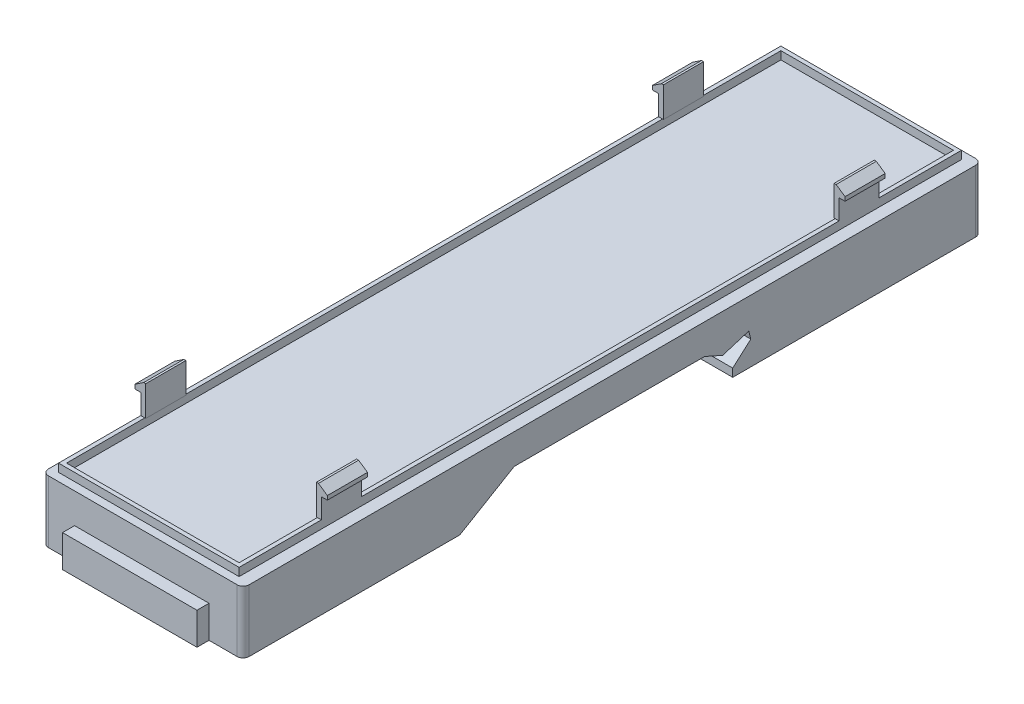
ISO-10303-21;
HEADER;
FILE_DESCRIPTION(('STEP AP214'),'2;1');
FILE_NAME('part.step','',(''),(''),'','','');
FILE_SCHEMA(('AUTOMOTIVE_DESIGN { 1 0 10303 214 1 1 1 1 }'));
ENDSEC;
DATA;
#1=APPLICATION_CONTEXT('core data for automotive mechanical design processes');
#2=APPLICATION_PROTOCOL_DEFINITION('international standard','automotive_design',2000,#1);
#3=PRODUCT_CONTEXT('',#1,'mechanical');
#4=PRODUCT('Part','Part','',(#3));
#5=PRODUCT_RELATED_PRODUCT_CATEGORY('part','',(#4));
#6=PRODUCT_DEFINITION_FORMATION('','',#4);
#7=PRODUCT_DEFINITION_CONTEXT('part definition',#1,'design');
#8=PRODUCT_DEFINITION('design','',#6,#7);
#9=PRODUCT_DEFINITION_SHAPE('','',#8);
#10=(LENGTH_UNIT() NAMED_UNIT(*) SI_UNIT(.MILLI.,.METRE.));
#11=(NAMED_UNIT(*) PLANE_ANGLE_UNIT() SI_UNIT($,.RADIAN.));
#12=(NAMED_UNIT(*) SI_UNIT($,.STERADIAN.) SOLID_ANGLE_UNIT());
#13=UNCERTAINTY_MEASURE_WITH_UNIT(LENGTH_MEASURE(1.E-05),#10,'distance_accuracy_value','');
#14=(GEOMETRIC_REPRESENTATION_CONTEXT(3) GLOBAL_UNCERTAINTY_ASSIGNED_CONTEXT((#13)) GLOBAL_UNIT_ASSIGNED_CONTEXT((#10,
#11,#12)) REPRESENTATION_CONTEXT('',''));
#15=CARTESIAN_POINT('',(0.,0.,0.));
#16=DIRECTION('',(0.,0.,1.));
#17=DIRECTION('',(1.,0.,0.));
#18=AXIS2_PLACEMENT_3D('',#15,#16,#17);
#19=CARTESIAN_POINT('',(0.,8.75,0.));
#20=DIRECTION('',(0.,-1.,0.));
#21=DIRECTION('',(0.,0.,-1.));
#22=AXIS2_PLACEMENT_3D('',#19,#20,#21);
#23=PLANE('',#22);
#24=DIRECTION('',(1.,0.,0.));
#25=VECTOR('',#24,1.);
#26=CARTESIAN_POINT('',(0.,8.75000000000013,-34.25));
#27=LINE('',#26,#25);
#28=CARTESIAN_POINT('',(23.,8.75,-34.25));
#29=VERTEX_POINT('',#28);
#30=CARTESIAN_POINT('',(23.5,8.75,-34.25));
#31=VERTEX_POINT('',#30);
#32=EDGE_CURVE('E253',#29,#31,#27,.T.);
#33=ORIENTED_EDGE('',*,*,#32,.T.);
#34=DIRECTION('',(0.,0.,1.));
#35=VECTOR('',#34,1.);
#36=CARTESIAN_POINT('',(23.5,8.75,-44.5));
#37=LINE('',#36,#35);
#38=CARTESIAN_POINT('',(23.5,8.75,-44.5));
#39=VERTEX_POINT('',#38);
#40=EDGE_CURVE('E880',#39,#31,#37,.T.);
#41=ORIENTED_EDGE('',*,*,#40,.F.);
#42=DIRECTION('',(1.,0.,0.));
#43=VECTOR('',#42,1.);
#44=CARTESIAN_POINT('',(1.,8.75,-44.5));
#45=LINE('',#44,#43);
#46=CARTESIAN_POINT('',(1.,8.75,-44.5));
#47=VERTEX_POINT('',#46);
#48=EDGE_CURVE('E875',#47,#39,#45,.T.);
#49=ORIENTED_EDGE('',*,*,#48,.F.);
#50=DIRECTION('',(0.,0.,1.));
#51=VECTOR('',#50,1.);
#52=CARTESIAN_POINT('',(1.,8.75,-44.5));
#53=LINE('',#52,#51);
#54=CARTESIAN_POINT('',(1.00000000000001,8.75,-34.25));
#55=VERTEX_POINT('',#54);
#56=EDGE_CURVE('E886',#47,#55,#53,.T.);
#57=ORIENTED_EDGE('',*,*,#56,.T.);
#58=DIRECTION('',(1.,0.,0.));
#59=VECTOR('',#58,1.);
#60=CARTESIAN_POINT('',(0.,8.75,-34.25));
#61=LINE('',#60,#59);
#62=CARTESIAN_POINT('',(1.5,8.75,-34.25));
#63=VERTEX_POINT('',#62);
#64=EDGE_CURVE('E690',#55,#63,#61,.T.);
#65=ORIENTED_EDGE('',*,*,#64,.T.);
#66=DIRECTION('',(0.,0.,1.));
#67=VECTOR('',#66,1.);
#68=CARTESIAN_POINT('',(1.5,8.75,-44.));
#69=LINE('',#68,#67);
#70=CARTESIAN_POINT('',(1.5,8.75,-44.));
#71=VERTEX_POINT('',#70);
#72=EDGE_CURVE('E850',#71,#63,#69,.T.);
#73=ORIENTED_EDGE('',*,*,#72,.F.);
#74=DIRECTION('',(1.,0.,0.));
#75=VECTOR('',#74,1.);
#76=CARTESIAN_POINT('',(1.5,8.75,-44.));
#77=LINE('',#76,#75);
#78=CARTESIAN_POINT('',(23.,8.75,-44.));
#79=VERTEX_POINT('',#78);
#80=EDGE_CURVE('E836',#71,#79,#77,.T.);
#81=ORIENTED_EDGE('',*,*,#80,.T.);
#82=DIRECTION('',(0.,0.,1.));
#83=VECTOR('',#82,1.);
#84=CARTESIAN_POINT('',(23.,8.75,-44.));
#85=LINE('',#84,#83);
#86=EDGE_CURVE('E841',#79,#29,#85,.T.);
#87=ORIENTED_EDGE('',*,*,#86,.T.);
#88=EDGE_LOOP('',(#33,#41,#49,#57,#65,#73,#81,#87));
#89=FACE_BOUND('',#88,.T.);
#90=ADVANCED_FACE('F230',(#89),#23,.F.);
#91=CARTESIAN_POINT('',(23.5,8.75,-29.25));
#92=VERTEX_POINT('',#91);
#93=CARTESIAN_POINT('',(23.5,8.75,30.25));
#94=VERTEX_POINT('',#93);
#95=EDGE_CURVE('E245',#92,#94,#37,.T.);
#96=ORIENTED_EDGE('',*,*,#95,.F.);
#97=DIRECTION('',(1.,0.,0.));
#98=VECTOR('',#97,1.);
#99=CARTESIAN_POINT('',(0.,8.75000000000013,-29.25));
#100=LINE('',#99,#98);
#101=CARTESIAN_POINT('',(23.,8.75,-29.25));
#102=VERTEX_POINT('',#101);
#103=EDGE_CURVE('E658',#102,#92,#100,.T.);
#104=ORIENTED_EDGE('',*,*,#103,.F.);
#105=CARTESIAN_POINT('',(23.,8.75,30.25));
#106=VERTEX_POINT('',#105);
#107=EDGE_CURVE('E845',#102,#106,#85,.T.);
#108=ORIENTED_EDGE('',*,*,#107,.T.);
#109=DIRECTION('',(1.,0.,0.));
#110=VECTOR('',#109,1.);
#111=CARTESIAN_POINT('',(0.,8.75000000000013,30.25));
#112=LINE('',#111,#110);
#113=EDGE_CURVE('E773',#106,#94,#112,.T.);
#114=ORIENTED_EDGE('',*,*,#113,.T.);
#115=EDGE_LOOP('',(#96,#104,#108,#114));
#116=FACE_BOUND('',#115,.T.);
#117=ADVANCED_FACE('F1126',(#116),#23,.F.);
#118=CARTESIAN_POINT('',(1.5,8.75,-29.25));
#119=VERTEX_POINT('',#118);
#120=CARTESIAN_POINT('',(1.50000000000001,8.75,30.25));
#121=VERTEX_POINT('',#120);
#122=EDGE_CURVE('E855',#119,#121,#69,.T.);
#123=ORIENTED_EDGE('',*,*,#122,.F.);
#124=DIRECTION('',(1.,0.,0.));
#125=VECTOR('',#124,1.);
#126=CARTESIAN_POINT('',(0.,8.75,-29.25));
#127=LINE('',#126,#125);
#128=CARTESIAN_POINT('',(1.00000000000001,8.75,-29.25));
#129=VERTEX_POINT('',#128);
#130=EDGE_CURVE('E710',#129,#119,#127,.T.);
#131=ORIENTED_EDGE('',*,*,#130,.F.);
#132=CARTESIAN_POINT('',(1.00000000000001,8.75,30.25));
#133=VERTEX_POINT('',#132);
#134=EDGE_CURVE('E890',#129,#133,#53,.T.);
#135=ORIENTED_EDGE('',*,*,#134,.T.);
#136=DIRECTION('',(1.,0.,0.));
#137=VECTOR('',#136,1.);
#138=CARTESIAN_POINT('',(0.,8.75,30.25));
#139=LINE('',#138,#137);
#140=EDGE_CURVE('E796',#133,#121,#139,.T.);
#141=ORIENTED_EDGE('',*,*,#140,.T.);
#142=EDGE_LOOP('',(#123,#131,#135,#141));
#143=FACE_BOUND('',#142,.T.);
#144=ADVANCED_FACE('F1132',(#143),#23,.F.);
#145=CARTESIAN_POINT('',(23.5,8.75,35.25));
#146=VERTEX_POINT('',#145);
#147=CARTESIAN_POINT('',(23.5,8.75,45.5));
#148=VERTEX_POINT('',#147);
#149=EDGE_CURVE('E878',#146,#148,#37,.T.);
#150=ORIENTED_EDGE('',*,*,#149,.F.);
#151=DIRECTION('',(1.,0.,0.));
#152=VECTOR('',#151,1.);
#153=CARTESIAN_POINT('',(0.,8.75000000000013,35.25));
#154=LINE('',#153,#152);
#155=CARTESIAN_POINT('',(23.,8.75,35.25));
#156=VERTEX_POINT('',#155);
#157=EDGE_CURVE('E753',#156,#146,#154,.T.);
#158=ORIENTED_EDGE('',*,*,#157,.F.);
#159=CARTESIAN_POINT('',(23.,8.75,45.));
#160=VERTEX_POINT('',#159);
#161=EDGE_CURVE('E839',#156,#160,#85,.T.);
#162=ORIENTED_EDGE('',*,*,#161,.T.);
#163=DIRECTION('',(1.,0.,0.));
#164=VECTOR('',#163,1.);
#165=CARTESIAN_POINT('',(1.50000000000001,8.75,45.));
#166=LINE('',#165,#164);
#167=CARTESIAN_POINT('',(1.50000000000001,8.75,45.));
#168=VERTEX_POINT('',#167);
#169=EDGE_CURVE('E843',#168,#160,#166,.T.);
#170=ORIENTED_EDGE('',*,*,#169,.F.);
#171=CARTESIAN_POINT('',(1.50000000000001,8.75,35.25));
#172=VERTEX_POINT('',#171);
#173=EDGE_CURVE('E849',#172,#168,#69,.T.);
#174=ORIENTED_EDGE('',*,*,#173,.F.);
#175=DIRECTION('',(1.,0.,0.));
#176=VECTOR('',#175,1.);
#177=CARTESIAN_POINT('',(0.,8.75,35.25));
#178=LINE('',#177,#176);
#179=CARTESIAN_POINT('',(1.00000000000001,8.75,35.25));
#180=VERTEX_POINT('',#179);
#181=EDGE_CURVE('E816',#180,#172,#178,.T.);
#182=ORIENTED_EDGE('',*,*,#181,.F.);
#183=CARTESIAN_POINT('',(1.00000000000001,8.75,45.5));
#184=VERTEX_POINT('',#183);
#185=EDGE_CURVE('E885',#180,#184,#53,.T.);
#186=ORIENTED_EDGE('',*,*,#185,.T.);
#187=DIRECTION('',(1.,0.,0.));
#188=VECTOR('',#187,1.);
#189=CARTESIAN_POINT('',(1.00000000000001,8.75,45.5));
#190=LINE('',#189,#188);
#191=EDGE_CURVE('E882',#184,#148,#190,.T.);
#192=ORIENTED_EDGE('',*,*,#191,.T.);
#193=EDGE_LOOP('',(#150,#158,#162,#170,#174,#182,#186,#192));
#194=FACE_BOUND('',#193,.T.);
#195=ADVANCED_FACE('F1128',(#194),#23,.F.);
#196=CARTESIAN_POINT('',(25.,0.,46.5));
#197=DIRECTION('',(0.,0.,1.));
#198=DIRECTION('',(1.,0.,0.));
#199=AXIS2_PLACEMENT_3D('',#196,#197,#198);
#200=PLANE('',#199);
#201=DIRECTION('',(-1.,0.,0.));
#202=VECTOR('',#201,1.);
#203=CARTESIAN_POINT('',(25.,7.74999999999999,46.5));
#204=LINE('',#203,#202);
#205=CARTESIAN_POINT('',(24.25,7.74999999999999,46.5));
#206=VERTEX_POINT('',#205);
#207=CARTESIAN_POINT('',(0.750000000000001,7.74999999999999,46.5));
#208=VERTEX_POINT('',#207);
#209=EDGE_CURVE('E999',#206,#208,#204,.T.);
#210=ORIENTED_EDGE('',*,*,#209,.T.);
#211=DIRECTION('',(0.,1.,0.));
#212=VECTOR('',#211,1.);
#213=CARTESIAN_POINT('',(0.75,0.,46.5));
#214=LINE('',#213,#212);
#215=CARTESIAN_POINT('',(0.750000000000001,0.,46.5));
#216=VERTEX_POINT('',#215);
#217=EDGE_CURVE('E1054',#208,#216,#214,.F.);
#218=ORIENTED_EDGE('',*,*,#217,.T.);
#219=DIRECTION('',(-1.,0.,0.));
#220=VECTOR('',#219,1.);
#221=CARTESIAN_POINT('',(25.,0.,46.5));
#222=LINE('',#221,#220);
#223=CARTESIAN_POINT('',(4.,0.,46.5));
#224=VERTEX_POINT('',#223);
#225=EDGE_CURVE('E996',#224,#216,#222,.T.);
#226=ORIENTED_EDGE('',*,*,#225,.F.);
#227=DIRECTION('',(0.,-1.,0.));
#228=VECTOR('',#227,1.);
#229=CARTESIAN_POINT('',(4.,0.,46.5));
#230=LINE('',#229,#228);
#231=CARTESIAN_POINT('',(4.,4.,46.5));
#232=VERTEX_POINT('',#231);
#233=EDGE_CURVE('E915',#232,#224,#230,.T.);
#234=ORIENTED_EDGE('',*,*,#233,.F.);
#235=DIRECTION('',(1.,0.,0.));
#236=VECTOR('',#235,1.);
#237=CARTESIAN_POINT('',(0.,4.,46.5));
#238=LINE('',#237,#236);
#239=CARTESIAN_POINT('',(20.75,4.,46.5));
#240=VERTEX_POINT('',#239);
#241=EDGE_CURVE('E925',#232,#240,#238,.T.);
#242=ORIENTED_EDGE('',*,*,#241,.T.);
#243=DIRECTION('',(0.,-1.,0.));
#244=VECTOR('',#243,1.);
#245=CARTESIAN_POINT('',(20.75,0.,46.5));
#246=LINE('',#245,#244);
#247=CARTESIAN_POINT('',(20.75,0.,46.5));
#248=VERTEX_POINT('',#247);
#249=EDGE_CURVE('E902',#240,#248,#246,.T.);
#250=ORIENTED_EDGE('',*,*,#249,.T.);
#251=CARTESIAN_POINT('',(24.25,0.,46.5));
#252=VERTEX_POINT('',#251);
#253=EDGE_CURVE('E997',#252,#248,#222,.T.);
#254=ORIENTED_EDGE('',*,*,#253,.F.);
#255=DIRECTION('',(0.,1.,0.));
#256=VECTOR('',#255,1.);
#257=CARTESIAN_POINT('',(24.25,0.,46.5));
#258=LINE('',#257,#256);
#259=EDGE_CURVE('E1051',#252,#206,#258,.T.);
#260=ORIENTED_EDGE('',*,*,#259,.T.);
#261=EDGE_LOOP('',(#210,#218,#226,#234,#242,#250,#254,#260));
#262=FACE_BOUND('',#261,.T.);
#263=ADVANCED_FACE('F1066',(#262),#200,.T.);
#264=CARTESIAN_POINT('',(25.,4.,0.));
#265=DIRECTION('',(0.,1.,0.));
#266=DIRECTION('',(0.,0.,1.));
#267=AXIS2_PLACEMENT_3D('',#264,#265,#266);
#268=PLANE('',#267);
#269=DIRECTION('',(0.,0.,-1.));
#270=VECTOR('',#269,1.);
#271=CARTESIAN_POINT('',(0.,4.,0.));
#272=LINE('',#271,#270);
#273=CARTESIAN_POINT('',(0.,4.,12.7240566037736));
#274=VERTEX_POINT('',#273);
#275=CARTESIAN_POINT('',(0.,4.,-11.));
#276=VERTEX_POINT('',#275);
#277=EDGE_CURVE('E939',#274,#276,#272,.T.);
#278=ORIENTED_EDGE('',*,*,#277,.T.);
#279=DIRECTION('',(-1.,0.,0.));
#280=VECTOR('',#279,1.);
#281=CARTESIAN_POINT('',(25.,4.,-11.));
#282=LINE('',#281,#280);
#283=CARTESIAN_POINT('',(25.,4.,-11.));
#284=VERTEX_POINT('',#283);
#285=EDGE_CURVE('E1021',#284,#276,#282,.T.);
#286=ORIENTED_EDGE('',*,*,#285,.F.);
#287=DIRECTION('',(0.,0.,-1.));
#288=VECTOR('',#287,1.);
#289=CARTESIAN_POINT('',(25.,4.,0.));
#290=LINE('',#289,#288);
#291=CARTESIAN_POINT('',(25.,4.,12.7240566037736));
#292=VERTEX_POINT('',#291);
#293=EDGE_CURVE('E940',#292,#284,#290,.T.);
#294=ORIENTED_EDGE('',*,*,#293,.F.);
#295=DIRECTION('',(-1.,0.,0.));
#296=VECTOR('',#295,1.);
#297=CARTESIAN_POINT('',(25.,4.,12.7240566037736));
#298=LINE('',#297,#296);
#299=EDGE_CURVE('E966',#292,#274,#298,.T.);
#300=ORIENTED_EDGE('',*,*,#299,.T.);
#301=EDGE_LOOP('',(#278,#286,#294,#300));
#302=FACE_BOUND('',#301,.T.);
#303=ADVANCED_FACE('F1141',(#302),#268,.F.);
#304=CARTESIAN_POINT('',(25.,7.42268041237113,-3.29896907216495));
#305=DIRECTION('',(0.,0.913811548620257,-0.406138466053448));
#306=DIRECTION('',(0.,0.406138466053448,0.913811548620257));
#307=AXIS2_PLACEMENT_3D('',#304,#305,#306);
#308=PLANE('',#307);
#309=DIRECTION('',(0.,-0.406138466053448,-0.913811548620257));
#310=VECTOR('',#309,1.);
#311=CARTESIAN_POINT('',(0.,7.42268041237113,-3.29896907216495));
#312=LINE('',#311,#310);
#313=CARTESIAN_POINT('',(0.,3.,-13.25));
#314=VERTEX_POINT('',#313);
#315=EDGE_CURVE('E969',#276,#314,#312,.T.);
#316=ORIENTED_EDGE('',*,*,#315,.T.);
#317=DIRECTION('',(-1.,0.,0.));
#318=VECTOR('',#317,1.);
#319=CARTESIAN_POINT('',(25.,3.,-13.25));
#320=LINE('',#319,#318);
#321=CARTESIAN_POINT('',(25.,3.,-13.25));
#322=VERTEX_POINT('',#321);
#323=EDGE_CURVE('E1018',#322,#314,#320,.T.);
#324=ORIENTED_EDGE('',*,*,#323,.F.);
#325=DIRECTION('',(0.,-0.406138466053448,-0.913811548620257));
#326=VECTOR('',#325,1.);
#327=CARTESIAN_POINT('',(25.,7.42268041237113,-3.29896907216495));
#328=LINE('',#327,#326);
#329=EDGE_CURVE('E943',#284,#322,#328,.T.);
#330=ORIENTED_EDGE('',*,*,#329,.F.);
#331=ORIENTED_EDGE('',*,*,#285,.T.);
#332=EDGE_LOOP('',(#316,#324,#330,#331));
#333=FACE_BOUND('',#332,.T.);
#334=ADVANCED_FACE('F1313',(#333),#308,.F.);
#335=CARTESIAN_POINT('',(25.,-0.983783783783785,-0.302702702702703));
#336=DIRECTION('',(0.,0.95577900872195,0.294085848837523));
#337=DIRECTION('',(0.,-0.294085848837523,0.95577900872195));
#338=AXIS2_PLACEMENT_3D('',#335,#336,#337);
#339=PLANE('',#338);
#340=DIRECTION('',(0.,0.294085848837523,-0.95577900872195));
#341=VECTOR('',#340,1.);
#342=CARTESIAN_POINT('',(0.,-0.983783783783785,-0.302702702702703));
#343=LINE('',#342,#341);
#344=CARTESIAN_POINT('',(0.,4.,-16.5));
#345=VERTEX_POINT('',#344);
#346=EDGE_CURVE('E971',#314,#345,#343,.T.);
#347=ORIENTED_EDGE('',*,*,#346,.T.);
#348=DIRECTION('',(-1.,0.,0.));
#349=VECTOR('',#348,1.);
#350=CARTESIAN_POINT('',(25.,4.,-16.5));
#351=LINE('',#350,#349);
#352=CARTESIAN_POINT('',(25.,4.,-16.5));
#353=VERTEX_POINT('',#352);
#354=EDGE_CURVE('E1015',#353,#345,#351,.T.);
#355=ORIENTED_EDGE('',*,*,#354,.F.);
#356=DIRECTION('',(0.,0.294085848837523,-0.95577900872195));
#357=VECTOR('',#356,1.);
#358=CARTESIAN_POINT('',(25.,-0.983783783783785,-0.302702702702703));
#359=LINE('',#358,#357);
#360=EDGE_CURVE('E946',#322,#353,#359,.T.);
#361=ORIENTED_EDGE('',*,*,#360,.F.);
#362=ORIENTED_EDGE('',*,*,#323,.T.);
#363=EDGE_LOOP('',(#347,#355,#361,#362));
#364=FACE_BOUND('',#363,.T.);
#365=ADVANCED_FACE('F1317',(#364),#339,.F.);
#366=CARTESIAN_POINT('',(25.,4.11764705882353,-16.4705882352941));
#367=DIRECTION('',(0.,0.242535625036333,-0.970142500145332));
#368=DIRECTION('',(0.,0.970142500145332,0.242535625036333));
#369=AXIS2_PLACEMENT_3D('',#366,#367,#368);
#370=PLANE('',#369);
#371=DIRECTION('',(0.,-0.970142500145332,-0.242535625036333));
#372=VECTOR('',#371,1.);
#373=CARTESIAN_POINT('',(0.,4.11764705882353,-16.4705882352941));
#374=LINE('',#373,#372);
#375=CARTESIAN_POINT('',(0.,3.,-16.75));
#376=VERTEX_POINT('',#375);
#377=EDGE_CURVE('E973',#345,#376,#374,.T.);
#378=ORIENTED_EDGE('',*,*,#377,.T.);
#379=DIRECTION('',(-1.,0.,0.));
#380=VECTOR('',#379,1.);
#381=CARTESIAN_POINT('',(25.,3.,-16.75));
#382=LINE('',#381,#380);
#383=CARTESIAN_POINT('',(25.,3.,-16.75));
#384=VERTEX_POINT('',#383);
#385=EDGE_CURVE('E1013',#384,#376,#382,.T.);
#386=ORIENTED_EDGE('',*,*,#385,.F.);
#387=DIRECTION('',(0.,-0.970142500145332,-0.242535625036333));
#388=VECTOR('',#387,1.);
#389=CARTESIAN_POINT('',(25.,4.11764705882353,-16.4705882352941));
#390=LINE('',#389,#388);
#391=EDGE_CURVE('E948',#353,#384,#390,.T.);
#392=ORIENTED_EDGE('',*,*,#391,.F.);
#393=ORIENTED_EDGE('',*,*,#354,.T.);
#394=EDGE_LOOP('',(#378,#386,#392,#393));
#395=FACE_BOUND('',#394,.T.);
#396=ADVANCED_FACE('F1321',(#395),#370,.F.);
#397=CARTESIAN_POINT('',(25.,-6.64137931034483,-5.90344827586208));
#398=DIRECTION('',(0.,0.747409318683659,0.66436383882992));
#399=DIRECTION('',(0.,-0.66436383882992,0.747409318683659));
#400=AXIS2_PLACEMENT_3D('',#397,#398,#399);
#401=PLANE('',#400);
#402=DIRECTION('',(0.,0.66436383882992,-0.747409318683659));
#403=VECTOR('',#402,1.);
#404=CARTESIAN_POINT('',(0.,-6.64137931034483,-5.90344827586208));
#405=LINE('',#404,#403);
#406=CARTESIAN_POINT('',(0.,0.999999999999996,-14.5));
#407=VERTEX_POINT('',#406);
#408=EDGE_CURVE('E976',#407,#376,#405,.T.);
#409=ORIENTED_EDGE('',*,*,#408,.F.);
#410=DIRECTION('',(-1.,0.,0.));
#411=VECTOR('',#410,1.);
#412=CARTESIAN_POINT('',(25.,0.999999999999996,-14.5));
#413=LINE('',#412,#411);
#414=CARTESIAN_POINT('',(25.,0.999999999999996,-14.5));
#415=VERTEX_POINT('',#414);
#416=EDGE_CURVE('E1011',#415,#407,#413,.T.);
#417=ORIENTED_EDGE('',*,*,#416,.F.);
#418=DIRECTION('',(0.,0.66436383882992,-0.747409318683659));
#419=VECTOR('',#418,1.);
#420=CARTESIAN_POINT('',(25.,-6.64137931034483,-5.90344827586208));
#421=LINE('',#420,#419);
#422=EDGE_CURVE('E950',#415,#384,#421,.T.);
#423=ORIENTED_EDGE('',*,*,#422,.T.);
#424=ORIENTED_EDGE('',*,*,#385,.T.);
#425=EDGE_LOOP('',(#409,#417,#423,#424));
#426=FACE_BOUND('',#425,.T.);
#427=ADVANCED_FACE('F1325',(#426),#401,.T.);
#428=CARTESIAN_POINT('',(25.,0.,-14.5));
#429=DIRECTION('',(0.,0.,1.));
#430=DIRECTION('',(1.,0.,0.));
#431=AXIS2_PLACEMENT_3D('',#428,#429,#430);
#432=PLANE('',#431);
#433=DIRECTION('',(0.,1.,0.));
#434=VECTOR('',#433,1.);
#435=CARTESIAN_POINT('',(0.,0.,-14.5));
#436=LINE('',#435,#434);
#437=CARTESIAN_POINT('',(0.,0.,-14.5));
#438=VERTEX_POINT('',#437);
#439=EDGE_CURVE('E979',#438,#407,#436,.T.);
#440=ORIENTED_EDGE('',*,*,#439,.F.);
#441=DIRECTION('',(-1.,0.,0.));
#442=VECTOR('',#441,1.);
#443=CARTESIAN_POINT('',(25.,0.,-14.5));
#444=LINE('',#443,#442);
#445=CARTESIAN_POINT('',(25.,0.,-14.5));
#446=VERTEX_POINT('',#445);
#447=EDGE_CURVE('E1008',#446,#438,#444,.T.);
#448=ORIENTED_EDGE('',*,*,#447,.F.);
#449=DIRECTION('',(0.,1.,0.));
#450=VECTOR('',#449,1.);
#451=CARTESIAN_POINT('',(25.,0.,-14.5));
#452=LINE('',#451,#450);
#453=EDGE_CURVE('E953',#446,#415,#452,.T.);
#454=ORIENTED_EDGE('',*,*,#453,.T.);
#455=ORIENTED_EDGE('',*,*,#416,.T.);
#456=EDGE_LOOP('',(#440,#448,#454,#455));
#457=FACE_BOUND('',#456,.T.);
#458=ADVANCED_FACE('F1329',(#457),#432,.T.);
#459=CARTESIAN_POINT('',(25.,0.,0.));
#460=DIRECTION('',(0.,-1.,0.));
#461=DIRECTION('',(0.,0.,-1.));
#462=AXIS2_PLACEMENT_3D('',#459,#460,#461);
#463=PLANE('',#462);
#464=DIRECTION('',(0.,0.,1.));
#465=VECTOR('',#464,1.);
#466=CARTESIAN_POINT('',(0.,0.,0.));
#467=LINE('',#466,#465);
#468=CARTESIAN_POINT('',(0.,0.,-44.75));
#469=VERTEX_POINT('',#468);
#470=EDGE_CURVE('E982',#469,#438,#467,.T.);
#471=ORIENTED_EDGE('',*,*,#470,.F.);
#472=CARTESIAN_POINT('',(0.75,0.,-44.75));
#473=DIRECTION('',(0.,-1.,0.));
#474=DIRECTION('',(0.,0.,-1.));
#475=AXIS2_PLACEMENT_3D('',#472,#473,#474);
#476=CIRCLE('',#475,0.75);
#477=CARTESIAN_POINT('',(0.750000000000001,0.,-45.5));
#478=VERTEX_POINT('',#477);
#479=EDGE_CURVE('E1032',#469,#478,#476,.T.);
#480=ORIENTED_EDGE('',*,*,#479,.T.);
#481=DIRECTION('',(-1.,0.,0.));
#482=VECTOR('',#481,1.);
#483=CARTESIAN_POINT('',(25.,0.,-45.5));
#484=LINE('',#483,#482);
#485=CARTESIAN_POINT('',(24.25,0.,-45.5));
#486=VERTEX_POINT('',#485);
#487=EDGE_CURVE('E1005',#486,#478,#484,.T.);
#488=ORIENTED_EDGE('',*,*,#487,.F.);
#489=CARTESIAN_POINT('',(24.25,0.,-44.75));
#490=DIRECTION('',(0.,-1.,0.));
#491=DIRECTION('',(0.,0.,-1.));
#492=AXIS2_PLACEMENT_3D('',#489,#490,#491);
#493=CIRCLE('',#492,0.75);
#494=CARTESIAN_POINT('',(25.,0.,-44.75));
#495=VERTEX_POINT('',#494);
#496=EDGE_CURVE('E1030',#486,#495,#493,.T.);
#497=ORIENTED_EDGE('',*,*,#496,.T.);
#498=DIRECTION('',(0.,0.,1.));
#499=VECTOR('',#498,1.);
#500=CARTESIAN_POINT('',(25.,0.,0.));
#501=LINE('',#500,#499);
#502=EDGE_CURVE('E956',#495,#446,#501,.T.);
#503=ORIENTED_EDGE('',*,*,#502,.T.);
#504=ORIENTED_EDGE('',*,*,#447,.T.);
#505=EDGE_LOOP('',(#471,#480,#488,#497,#503,#504));
#506=FACE_BOUND('',#505,.T.);
#507=ADVANCED_FACE('F1333',(#506),#463,.T.);
#508=CARTESIAN_POINT('',(25.,0.,-45.5));
#509=DIRECTION('',(0.,0.,-1.));
#510=DIRECTION('',(-1.,0.,0.));
#511=AXIS2_PLACEMENT_3D('',#508,#509,#510);
#512=PLANE('',#511);
#513=ORIENTED_EDGE('',*,*,#487,.T.);
#514=DIRECTION('',(0.,-1.,0.));
#515=VECTOR('',#514,1.);
#516=CARTESIAN_POINT('',(0.75,7.74999999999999,-45.5));
#517=LINE('',#516,#515);
#518=CARTESIAN_POINT('',(0.750000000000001,7.74999999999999,-45.5));
#519=VERTEX_POINT('',#518);
#520=EDGE_CURVE('E1037',#478,#519,#517,.F.);
#521=ORIENTED_EDGE('',*,*,#520,.T.);
#522=DIRECTION('',(-1.,0.,0.));
#523=VECTOR('',#522,1.);
#524=CARTESIAN_POINT('',(25.,7.74999999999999,-45.5));
#525=LINE('',#524,#523);
#526=CARTESIAN_POINT('',(24.25,7.74999999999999,-45.5));
#527=VERTEX_POINT('',#526);
#528=EDGE_CURVE('E1002',#527,#519,#525,.T.);
#529=ORIENTED_EDGE('',*,*,#528,.F.);
#530=DIRECTION('',(0.,-1.,0.));
#531=VECTOR('',#530,1.);
#532=CARTESIAN_POINT('',(24.25,0.,-45.5));
#533=LINE('',#532,#531);
#534=EDGE_CURVE('E1034',#527,#486,#533,.T.);
#535=ORIENTED_EDGE('',*,*,#534,.T.);
#536=EDGE_LOOP('',(#513,#521,#529,#535));
#537=FACE_BOUND('',#536,.T.);
#538=ADVANCED_FACE('F1083',(#537),#512,.T.);
#539=CARTESIAN_POINT('',(25.,7.74999999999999,0.));
#540=DIRECTION('',(0.,1.,0.));
#541=DIRECTION('',(0.,0.,1.));
#542=AXIS2_PLACEMENT_3D('',#539,#540,#541);
#543=PLANE('',#542);
#544=DIRECTION('',(1.,0.,0.));
#545=VECTOR('',#544,1.);
#546=CARTESIAN_POINT('',(1.,7.75,-44.5));
#547=LINE('',#546,#545);
#548=CARTESIAN_POINT('',(1.,7.74999999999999,-44.5));
#549=VERTEX_POINT('',#548);
#550=CARTESIAN_POINT('',(23.5,7.75,-44.5));
#551=VERTEX_POINT('',#550);
#552=EDGE_CURVE('E869',#549,#551,#547,.T.);
#553=ORIENTED_EDGE('',*,*,#552,.T.);
#554=DIRECTION('',(0.,0.,1.));
#555=VECTOR('',#554,1.);
#556=CARTESIAN_POINT('',(23.5,7.75,-44.5));
#557=LINE('',#556,#555);
#558=CARTESIAN_POINT('',(23.5,7.74999999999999,45.5));
#559=VERTEX_POINT('',#558);
#560=EDGE_CURVE('E892',#551,#559,#557,.T.);
#561=ORIENTED_EDGE('',*,*,#560,.T.);
#562=DIRECTION('',(1.,0.,0.));
#563=VECTOR('',#562,1.);
#564=CARTESIAN_POINT('',(1.00000000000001,7.75,45.5));
#565=LINE('',#564,#563);
#566=CARTESIAN_POINT('',(1.00000000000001,7.74999999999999,45.5));
#567=VERTEX_POINT('',#566);
#568=EDGE_CURVE('E894',#567,#559,#565,.T.);
#569=ORIENTED_EDGE('',*,*,#568,.F.);
#570=DIRECTION('',(0.,0.,1.));
#571=VECTOR('',#570,1.);
#572=CARTESIAN_POINT('',(1.,7.75,-44.5));
#573=LINE('',#572,#571);
#574=EDGE_CURVE('E879',#549,#567,#573,.T.);
#575=ORIENTED_EDGE('',*,*,#574,.F.);
#576=EDGE_LOOP('',(#553,#561,#569,#575));
#577=FACE_BOUND('',#576,.T.);
#578=ORIENTED_EDGE('',*,*,#528,.T.);
#579=CARTESIAN_POINT('',(0.75,7.74999999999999,-44.75));
#580=DIRECTION('',(0.,1.,0.));
#581=DIRECTION('',(0.,0.,1.));
#582=AXIS2_PLACEMENT_3D('',#579,#580,#581);
#583=CIRCLE('',#582,0.75);
#584=CARTESIAN_POINT('',(0.,7.74999999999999,-44.75));
#585=VERTEX_POINT('',#584);
#586=EDGE_CURVE('E1045',#519,#585,#583,.T.);
#587=ORIENTED_EDGE('',*,*,#586,.T.);
#588=DIRECTION('',(0.,0.,-1.));
#589=VECTOR('',#588,1.);
#590=CARTESIAN_POINT('',(0.,7.74999999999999,0.));
#591=LINE('',#590,#589);
#592=CARTESIAN_POINT('',(0.,7.74999999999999,45.75));
#593=VERTEX_POINT('',#592);
#594=EDGE_CURVE('E984',#593,#585,#591,.T.);
#595=ORIENTED_EDGE('',*,*,#594,.F.);
#596=CARTESIAN_POINT('',(0.75,7.74999999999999,45.75));
#597=DIRECTION('',(0.,1.,0.));
#598=DIRECTION('',(0.,0.,1.));
#599=AXIS2_PLACEMENT_3D('',#596,#597,#598);
#600=CIRCLE('',#599,0.75);
#601=EDGE_CURVE('E1041',#593,#208,#600,.T.);
#602=ORIENTED_EDGE('',*,*,#601,.T.);
#603=ORIENTED_EDGE('',*,*,#209,.F.);
#604=CARTESIAN_POINT('',(24.25,7.74999999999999,45.75));
#605=DIRECTION('',(0.,1.,0.));
#606=DIRECTION('',(0.,0.,1.));
#607=AXIS2_PLACEMENT_3D('',#604,#605,#606);
#608=CIRCLE('',#607,0.75);
#609=CARTESIAN_POINT('',(25.,7.74999999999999,45.75));
#610=VERTEX_POINT('',#609);
#611=EDGE_CURVE('E1039',#206,#610,#608,.T.);
#612=ORIENTED_EDGE('',*,*,#611,.T.);
#613=DIRECTION('',(0.,0.,-1.));
#614=VECTOR('',#613,1.);
#615=CARTESIAN_POINT('',(25.,7.74999999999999,0.));
#616=LINE('',#615,#614);
#617=CARTESIAN_POINT('',(25.,7.74999999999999,-44.75));
#618=VERTEX_POINT('',#617);
#619=EDGE_CURVE('E958',#610,#618,#616,.T.);
#620=ORIENTED_EDGE('',*,*,#619,.T.);
#621=CARTESIAN_POINT('',(24.25,7.74999999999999,-44.75));
#622=DIRECTION('',(0.,1.,0.));
#623=DIRECTION('',(0.,0.,1.));
#624=AXIS2_PLACEMENT_3D('',#621,#622,#623);
#625=CIRCLE('',#624,0.75);
#626=EDGE_CURVE('E1043',#618,#527,#625,.T.);
#627=ORIENTED_EDGE('',*,*,#626,.T.);
#628=EDGE_LOOP('',(#578,#587,#595,#602,#603,#612,#620,#627));
#629=FACE_BOUND('',#628,.T.);
#630=ADVANCED_FACE('F1070',(#577,#629),#543,.T.);
#631=CARTESIAN_POINT('',(25.,0.,0.));
#632=DIRECTION('',(0.,-1.,0.));
#633=DIRECTION('',(0.,0.,-1.));
#634=AXIS2_PLACEMENT_3D('',#631,#632,#633);
#635=PLANE('',#634);
#636=ORIENTED_EDGE('',*,*,#225,.T.);
#637=CARTESIAN_POINT('',(0.75,0.,45.75));
#638=DIRECTION('',(0.,-1.,0.));
#639=DIRECTION('',(0.,0.,-1.));
#640=AXIS2_PLACEMENT_3D('',#637,#638,#639);
#641=CIRCLE('',#640,0.75);
#642=CARTESIAN_POINT('',(0.,0.,45.75));
#643=VERTEX_POINT('',#642);
#644=EDGE_CURVE('E12',#216,#643,#641,.T.);
#645=ORIENTED_EDGE('',*,*,#644,.T.);
#646=DIRECTION('',(0.,0.,1.));
#647=VECTOR('',#646,1.);
#648=CARTESIAN_POINT('',(0.,0.,0.));
#649=LINE('',#648,#647);
#650=CARTESIAN_POINT('',(0.,0.,19.5));
#651=VERTEX_POINT('',#650);
#652=EDGE_CURVE('E987',#651,#643,#649,.T.);
#653=ORIENTED_EDGE('',*,*,#652,.F.);
#654=DIRECTION('',(-1.,0.,0.));
#655=VECTOR('',#654,1.);
#656=CARTESIAN_POINT('',(25.,0.,19.5));
#657=LINE('',#656,#655);
#658=CARTESIAN_POINT('',(25.,0.,19.5));
#659=VERTEX_POINT('',#658);
#660=EDGE_CURVE('E994',#659,#651,#657,.T.);
#661=ORIENTED_EDGE('',*,*,#660,.F.);
#662=DIRECTION('',(0.,0.,1.));
#663=VECTOR('',#662,1.);
#664=CARTESIAN_POINT('',(25.,0.,0.));
#665=LINE('',#664,#663);
#666=CARTESIAN_POINT('',(25.,0.,45.75));
#667=VERTEX_POINT('',#666);
#668=EDGE_CURVE('E961',#659,#667,#665,.T.);
#669=ORIENTED_EDGE('',*,*,#668,.T.);
#670=CARTESIAN_POINT('',(24.25,0.,45.75));
#671=DIRECTION('',(0.,-1.,0.));
#672=DIRECTION('',(0.,0.,-1.));
#673=AXIS2_PLACEMENT_3D('',#670,#671,#672);
#674=CIRCLE('',#673,0.75);
#675=EDGE_CURVE('E238',#667,#252,#674,.T.);
#676=ORIENTED_EDGE('',*,*,#675,.T.);
#677=ORIENTED_EDGE('',*,*,#253,.T.);
#678=DIRECTION('',(0.,0.,-1.));
#679=VECTOR('',#678,1.);
#680=CARTESIAN_POINT('',(20.75,0.,48.));
#681=LINE('',#680,#679);
#682=CARTESIAN_POINT('',(20.75,0.,48.));
#683=VERTEX_POINT('',#682);
#684=EDGE_CURVE('E922',#683,#248,#681,.T.);
#685=ORIENTED_EDGE('',*,*,#684,.F.);
#686=DIRECTION('',(1.,0.,0.));
#687=VECTOR('',#686,1.);
#688=CARTESIAN_POINT('',(0.,0.,48.));
#689=LINE('',#688,#687);
#690=CARTESIAN_POINT('',(4.,0.,48.));
#691=VERTEX_POINT('',#690);
#692=EDGE_CURVE('E920',#691,#683,#689,.T.);
#693=ORIENTED_EDGE('',*,*,#692,.F.);
#694=DIRECTION('',(0.,0.,-1.));
#695=VECTOR('',#694,1.);
#696=CARTESIAN_POINT('',(4.,0.,48.));
#697=LINE('',#696,#695);
#698=EDGE_CURVE('E931',#691,#224,#697,.T.);
#699=ORIENTED_EDGE('',*,*,#698,.T.);
#700=EDGE_LOOP('',(#636,#645,#653,#661,#669,#676,#677,#685,#693,#699));
#701=FACE_BOUND('',#700,.T.);
#702=ADVANCED_FACE('F1059',(#701),#635,.T.);
#703=CARTESIAN_POINT('',(25.,8.53649628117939,5.03929609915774));
#704=DIRECTION('',(0.,0.86114723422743,0.508355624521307));
#705=DIRECTION('',(0.,-0.508355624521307,0.86114723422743));
#706=AXIS2_PLACEMENT_3D('',#703,#704,#705);
#707=PLANE('',#706);
#708=DIRECTION('',(0.,0.508355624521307,-0.86114723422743));
#709=VECTOR('',#708,1.);
#710=CARTESIAN_POINT('',(0.,8.53649628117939,5.03929609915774));
#711=LINE('',#710,#709);
#712=EDGE_CURVE('E944',#651,#274,#711,.T.);
#713=ORIENTED_EDGE('',*,*,#712,.T.);
#714=ORIENTED_EDGE('',*,*,#299,.F.);
#715=DIRECTION('',(0.,0.508355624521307,-0.86114723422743));
#716=VECTOR('',#715,1.);
#717=CARTESIAN_POINT('',(25.,8.53649628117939,5.03929609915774));
#718=LINE('',#717,#716);
#719=EDGE_CURVE('E964',#659,#292,#718,.T.);
#720=ORIENTED_EDGE('',*,*,#719,.F.);
#721=ORIENTED_EDGE('',*,*,#660,.T.);
#722=EDGE_LOOP('',(#713,#714,#720,#721));
#723=FACE_BOUND('',#722,.T.);
#724=ADVANCED_FACE('F1345',(#723),#707,.F.);
#725=CARTESIAN_POINT('',(25.,0.,0.));
#726=DIRECTION('',(1.,0.,0.));
#727=DIRECTION('',(0.,0.,-1.));
#728=AXIS2_PLACEMENT_3D('',#725,#726,#727);
#729=PLANE('',#728);
#730=ORIENTED_EDGE('',*,*,#502,.F.);
#731=DIRECTION('',(0.,-1.,0.));
#732=VECTOR('',#731,1.);
#733=CARTESIAN_POINT('',(25.,0.,-44.75));
#734=LINE('',#733,#732);
#735=EDGE_CURVE('E1049',#495,#618,#734,.F.);
#736=ORIENTED_EDGE('',*,*,#735,.T.);
#737=ORIENTED_EDGE('',*,*,#619,.F.);
#738=DIRECTION('',(0.,1.,0.));
#739=VECTOR('',#738,1.);
#740=CARTESIAN_POINT('',(25.,0.,45.75));
#741=LINE('',#740,#739);
#742=EDGE_CURVE('E1047',#610,#667,#741,.F.);
#743=ORIENTED_EDGE('',*,*,#742,.T.);
#744=ORIENTED_EDGE('',*,*,#668,.F.);
#745=ORIENTED_EDGE('',*,*,#719,.T.);
#746=ORIENTED_EDGE('',*,*,#293,.T.);
#747=ORIENTED_EDGE('',*,*,#329,.T.);
#748=ORIENTED_EDGE('',*,*,#360,.T.);
#749=ORIENTED_EDGE('',*,*,#391,.T.);
#750=ORIENTED_EDGE('',*,*,#422,.F.);
#751=ORIENTED_EDGE('',*,*,#453,.F.);
#752=EDGE_LOOP('',(#730,#736,#737,#743,#744,#745,#746,#747,#748,#749,#750,#751));
#753=FACE_BOUND('',#752,.T.);
#754=ADVANCED_FACE('F1074',(#753),#729,.T.);
#755=CARTESIAN_POINT('',(0.,0.,0.));
#756=DIRECTION('',(1.,0.,0.));
#757=DIRECTION('',(0.,0.,-1.));
#758=AXIS2_PLACEMENT_3D('',#755,#756,#757);
#759=PLANE('',#758);
#760=ORIENTED_EDGE('',*,*,#594,.T.);
#761=DIRECTION('',(0.,-1.,0.));
#762=VECTOR('',#761,1.);
#763=CARTESIAN_POINT('',(0.,0.,-44.75));
#764=LINE('',#763,#762);
#765=EDGE_CURVE('E1027',#585,#469,#764,.T.);
#766=ORIENTED_EDGE('',*,*,#765,.T.);
#767=ORIENTED_EDGE('',*,*,#470,.T.);
#768=ORIENTED_EDGE('',*,*,#439,.T.);
#769=ORIENTED_EDGE('',*,*,#408,.T.);
#770=ORIENTED_EDGE('',*,*,#377,.F.);
#771=ORIENTED_EDGE('',*,*,#346,.F.);
#772=ORIENTED_EDGE('',*,*,#315,.F.);
#773=ORIENTED_EDGE('',*,*,#277,.F.);
#774=ORIENTED_EDGE('',*,*,#712,.F.);
#775=ORIENTED_EDGE('',*,*,#652,.T.);
#776=DIRECTION('',(0.,1.,0.));
#777=VECTOR('',#776,1.);
#778=CARTESIAN_POINT('',(0.,7.74999999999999,45.75));
#779=LINE('',#778,#777);
#780=EDGE_CURVE('E1024',#643,#593,#779,.T.);
#781=ORIENTED_EDGE('',*,*,#780,.T.);
#782=EDGE_LOOP('',(#760,#766,#767,#768,#769,#770,#771,#772,#773,#774,#775,#781));
#783=FACE_BOUND('',#782,.T.);
#784=ADVANCED_FACE('F1091',(#783),#759,.F.);
#785=CARTESIAN_POINT('',(20.75,0.,48.));
#786=DIRECTION('',(1.,0.,0.));
#787=DIRECTION('',(0.,0.,-1.));
#788=AXIS2_PLACEMENT_3D('',#785,#786,#787);
#789=PLANE('',#788);
#790=ORIENTED_EDGE('',*,*,#249,.F.);
#791=DIRECTION('',(0.,0.,-1.));
#792=VECTOR('',#791,1.);
#793=CARTESIAN_POINT('',(20.75,4.,48.));
#794=LINE('',#793,#792);
#795=CARTESIAN_POINT('',(20.75,4.,48.));
#796=VERTEX_POINT('',#795);
#797=EDGE_CURVE('E936',#796,#240,#794,.T.);
#798=ORIENTED_EDGE('',*,*,#797,.F.);
#799=DIRECTION('',(0.,-1.,0.));
#800=VECTOR('',#799,1.);
#801=CARTESIAN_POINT('',(20.75,0.,48.));
#802=LINE('',#801,#800);
#803=EDGE_CURVE('E911',#796,#683,#802,.T.);
#804=ORIENTED_EDGE('',*,*,#803,.T.);
#805=ORIENTED_EDGE('',*,*,#684,.T.);
#806=EDGE_LOOP('',(#790,#798,#804,#805));
#807=FACE_BOUND('',#806,.T.);
#808=ADVANCED_FACE('F1113',(#807),#789,.T.);
#809=CARTESIAN_POINT('',(0.,4.,48.));
#810=DIRECTION('',(0.,1.,0.));
#811=DIRECTION('',(0.,0.,1.));
#812=AXIS2_PLACEMENT_3D('',#809,#810,#811);
#813=PLANE('',#812);
#814=ORIENTED_EDGE('',*,*,#241,.F.);
#815=DIRECTION('',(0.,0.,-1.));
#816=VECTOR('',#815,1.);
#817=CARTESIAN_POINT('',(4.,4.,48.));
#818=LINE('',#817,#816);
#819=CARTESIAN_POINT('',(4.,4.,48.));
#820=VERTEX_POINT('',#819);
#821=EDGE_CURVE('E934',#820,#232,#818,.T.);
#822=ORIENTED_EDGE('',*,*,#821,.F.);
#823=DIRECTION('',(1.,0.,0.));
#824=VECTOR('',#823,1.);
#825=CARTESIAN_POINT('',(0.,4.,48.));
#826=LINE('',#825,#824);
#827=EDGE_CURVE('E914',#820,#796,#826,.T.);
#828=ORIENTED_EDGE('',*,*,#827,.T.);
#829=ORIENTED_EDGE('',*,*,#797,.T.);
#830=EDGE_LOOP('',(#814,#822,#828,#829));
#831=FACE_BOUND('',#830,.T.);
#832=ADVANCED_FACE('F1110',(#831),#813,.T.);
#833=CARTESIAN_POINT('',(4.,0.,48.));
#834=DIRECTION('',(1.,0.,0.));
#835=DIRECTION('',(0.,1.,0.));
#836=AXIS2_PLACEMENT_3D('',#833,#834,#835);
#837=PLANE('',#836);
#838=ORIENTED_EDGE('',*,*,#233,.T.);
#839=ORIENTED_EDGE('',*,*,#698,.F.);
#840=DIRECTION('',(0.,-1.,0.));
#841=VECTOR('',#840,1.);
#842=CARTESIAN_POINT('',(4.,0.,48.));
#843=LINE('',#842,#841);
#844=EDGE_CURVE('E918',#820,#691,#843,.T.);
#845=ORIENTED_EDGE('',*,*,#844,.F.);
#846=ORIENTED_EDGE('',*,*,#821,.T.);
#847=EDGE_LOOP('',(#838,#839,#845,#846));
#848=FACE_BOUND('',#847,.T.);
#849=ADVANCED_FACE('F1106',(#848),#837,.F.);
#850=CARTESIAN_POINT('',(0.,0.,48.));
#851=DIRECTION('',(0.,0.,1.));
#852=DIRECTION('',(1.,0.,0.));
#853=AXIS2_PLACEMENT_3D('',#850,#851,#852);
#854=PLANE('',#853);
#855=ORIENTED_EDGE('',*,*,#803,.F.);
#856=ORIENTED_EDGE('',*,*,#827,.F.);
#857=ORIENTED_EDGE('',*,*,#844,.T.);
#858=ORIENTED_EDGE('',*,*,#692,.T.);
#859=EDGE_LOOP('',(#855,#856,#857,#858));
#860=FACE_BOUND('',#859,.T.);
#861=ADVANCED_FACE('F1115',(#860),#854,.T.);
#862=CARTESIAN_POINT('',(0.75,0.,-44.75));
#863=DIRECTION('',(0.,1.,0.));
#864=DIRECTION('',(0.,0.,1.));
#865=AXIS2_PLACEMENT_3D('',#862,#863,#864);
#866=CYLINDRICAL_SURFACE('',#865,0.75);
#867=ORIENTED_EDGE('',*,*,#586,.F.);
#868=ORIENTED_EDGE('',*,*,#520,.F.);
#869=ORIENTED_EDGE('',*,*,#479,.F.);
#870=ORIENTED_EDGE('',*,*,#765,.F.);
#871=EDGE_LOOP('',(#867,#868,#869,#870));
#872=FACE_BOUND('',#871,.T.);
#873=ADVANCED_FACE('F1087',(#872),#866,.T.);
#874=CARTESIAN_POINT('',(24.25,0.,-44.75));
#875=DIRECTION('',(0.,-1.,0.));
#876=DIRECTION('',(0.,0.,-1.));
#877=AXIS2_PLACEMENT_3D('',#874,#875,#876);
#878=CYLINDRICAL_SURFACE('',#877,0.75);
#879=ORIENTED_EDGE('',*,*,#626,.F.);
#880=ORIENTED_EDGE('',*,*,#735,.F.);
#881=ORIENTED_EDGE('',*,*,#496,.F.);
#882=ORIENTED_EDGE('',*,*,#534,.F.);
#883=EDGE_LOOP('',(#879,#880,#881,#882));
#884=FACE_BOUND('',#883,.T.);
#885=ADVANCED_FACE('F1078',(#884),#878,.T.);
#886=CARTESIAN_POINT('',(0.75,0.,45.75));
#887=DIRECTION('',(0.,-1.,0.));
#888=DIRECTION('',(0.,0.,-1.));
#889=AXIS2_PLACEMENT_3D('',#886,#887,#888);
#890=CYLINDRICAL_SURFACE('',#889,0.75);
#891=ORIENTED_EDGE('',*,*,#644,.F.);
#892=ORIENTED_EDGE('',*,*,#217,.F.);
#893=ORIENTED_EDGE('',*,*,#601,.F.);
#894=ORIENTED_EDGE('',*,*,#780,.F.);
#895=EDGE_LOOP('',(#891,#892,#893,#894));
#896=FACE_BOUND('',#895,.T.);
#897=ADVANCED_FACE('F1098',(#896),#890,.T.);
#898=CARTESIAN_POINT('',(24.25,0.,45.75));
#899=DIRECTION('',(0.,1.,0.));
#900=DIRECTION('',(0.,0.,1.));
#901=AXIS2_PLACEMENT_3D('',#898,#899,#900);
#902=CYLINDRICAL_SURFACE('',#901,0.75);
#903=ORIENTED_EDGE('',*,*,#675,.F.);
#904=ORIENTED_EDGE('',*,*,#742,.F.);
#905=ORIENTED_EDGE('',*,*,#611,.F.);
#906=ORIENTED_EDGE('',*,*,#259,.F.);
#907=EDGE_LOOP('',(#903,#904,#905,#906));
#908=FACE_BOUND('',#907,.T.);
#909=ADVANCED_FACE('F232',(#908),#902,.T.);
#910=CARTESIAN_POINT('',(1.,8.75,-44.5));
#911=DIRECTION('',(0.,0.,-1.));
#912=DIRECTION('',(-1.,0.,0.));
#913=AXIS2_PLACEMENT_3D('',#910,#911,#912);
#914=PLANE('',#913);
#915=ORIENTED_EDGE('',*,*,#552,.F.);
#916=DIRECTION('',(0.,-1.,0.));
#917=VECTOR('',#916,1.);
#918=CARTESIAN_POINT('',(1.,8.75,-44.5));
#919=LINE('',#918,#917);
#920=EDGE_CURVE('E899',#47,#549,#919,.T.);
#921=ORIENTED_EDGE('',*,*,#920,.F.);
#922=ORIENTED_EDGE('',*,*,#48,.T.);
#923=DIRECTION('',(0.,-1.,0.));
#924=VECTOR('',#923,1.);
#925=CARTESIAN_POINT('',(23.5,8.75,-44.5));
#926=LINE('',#925,#924);
#927=EDGE_CURVE('E889',#39,#551,#926,.T.);
#928=ORIENTED_EDGE('',*,*,#927,.T.);
#929=EDGE_LOOP('',(#915,#921,#922,#928));
#930=FACE_BOUND('',#929,.T.);
#931=ADVANCED_FACE('F1205',(#930),#914,.T.);
#932=CARTESIAN_POINT('',(1.,8.75,-44.5));
#933=DIRECTION('',(1.,0.,0.));
#934=DIRECTION('',(0.,0.,-1.));
#935=AXIS2_PLACEMENT_3D('',#932,#933,#934);
#936=PLANE('',#935);
#937=ORIENTED_EDGE('',*,*,#574,.T.);
#938=DIRECTION('',(0.,-1.,0.));
#939=VECTOR('',#938,1.);
#940=CARTESIAN_POINT('',(1.00000000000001,8.75,45.5));
#941=LINE('',#940,#939);
#942=EDGE_CURVE('E903',#184,#567,#941,.T.);
#943=ORIENTED_EDGE('',*,*,#942,.F.);
#944=ORIENTED_EDGE('',*,*,#185,.F.);
#945=DIRECTION('',(0.,1.,0.));
#946=VECTOR('',#945,1.);
#947=CARTESIAN_POINT('',(1.00000000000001,0.,35.25));
#948=LINE('',#947,#946);
#949=CARTESIAN_POINT('',(1.00000000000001,11.25,35.25));
#950=VERTEX_POINT('',#949);
#951=EDGE_CURVE('E813',#180,#950,#948,.T.);
#952=ORIENTED_EDGE('',*,*,#951,.T.);
#953=DIRECTION('',(0.,0.,1.));
#954=VECTOR('',#953,1.);
#955=CARTESIAN_POINT('',(1.00000000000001,11.25,30.25));
#956=LINE('',#955,#954);
#957=CARTESIAN_POINT('',(1.00000000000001,11.25,30.25));
#958=VERTEX_POINT('',#957);
#959=EDGE_CURVE('E827',#958,#950,#956,.T.);
#960=ORIENTED_EDGE('',*,*,#959,.F.);
#961=DIRECTION('',(0.,1.,0.));
#962=VECTOR('',#961,1.);
#963=CARTESIAN_POINT('',(1.00000000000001,0.,30.25));
#964=LINE('',#963,#962);
#965=EDGE_CURVE('E793',#133,#958,#964,.T.);
#966=ORIENTED_EDGE('',*,*,#965,.F.);
#967=ORIENTED_EDGE('',*,*,#134,.F.);
#968=DIRECTION('',(0.,1.,0.));
#969=VECTOR('',#968,1.);
#970=CARTESIAN_POINT('',(1.00000000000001,0.,-29.25));
#971=LINE('',#970,#969);
#972=CARTESIAN_POINT('',(1.00000000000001,11.25,-29.25));
#973=VERTEX_POINT('',#972);
#974=EDGE_CURVE('E707',#129,#973,#971,.T.);
#975=ORIENTED_EDGE('',*,*,#974,.T.);
#976=DIRECTION('',(0.,0.,1.));
#977=VECTOR('',#976,1.);
#978=CARTESIAN_POINT('',(1.00000000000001,11.25,-34.25));
#979=LINE('',#978,#977);
#980=CARTESIAN_POINT('',(1.00000000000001,11.25,-34.25));
#981=VERTEX_POINT('',#980);
#982=EDGE_CURVE('E720',#981,#973,#979,.T.);
#983=ORIENTED_EDGE('',*,*,#982,.F.);
#984=DIRECTION('',(0.,1.,0.));
#985=VECTOR('',#984,1.);
#986=CARTESIAN_POINT('',(1.00000000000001,0.,-34.25));
#987=LINE('',#986,#985);
#988=EDGE_CURVE('E687',#55,#981,#987,.T.);
#989=ORIENTED_EDGE('',*,*,#988,.F.);
#990=ORIENTED_EDGE('',*,*,#56,.F.);
#991=ORIENTED_EDGE('',*,*,#920,.T.);
#992=EDGE_LOOP('',(#937,#943,#944,#952,#960,#966,#967,#975,#983,#989,#990,#991));
#993=FACE_BOUND('',#992,.T.);
#994=ADVANCED_FACE('F1208',(#993),#936,.F.);
#995=CARTESIAN_POINT('',(1.00000000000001,8.75,45.5));
#996=DIRECTION('',(0.,0.,-1.));
#997=DIRECTION('',(-1.,0.,0.));
#998=AXIS2_PLACEMENT_3D('',#995,#996,#997);
#999=PLANE('',#998);
#1000=ORIENTED_EDGE('',*,*,#568,.T.);
#1001=DIRECTION('',(0.,-1.,0.));
#1002=VECTOR('',#1001,1.);
#1003=CARTESIAN_POINT('',(23.5,8.75,45.5));
#1004=LINE('',#1003,#1002);
#1005=EDGE_CURVE('E906',#148,#559,#1004,.T.);
#1006=ORIENTED_EDGE('',*,*,#1005,.F.);
#1007=ORIENTED_EDGE('',*,*,#191,.F.);
#1008=ORIENTED_EDGE('',*,*,#942,.T.);
#1009=EDGE_LOOP('',(#1000,#1006,#1007,#1008));
#1010=FACE_BOUND('',#1009,.T.);
#1011=ADVANCED_FACE('F1291',(#1010),#999,.F.);
#1012=CARTESIAN_POINT('',(23.5,8.75,-44.5));
#1013=DIRECTION('',(1.,0.,0.));
#1014=DIRECTION('',(0.,0.,-1.));
#1015=AXIS2_PLACEMENT_3D('',#1012,#1013,#1014);
#1016=PLANE('',#1015);
#1017=ORIENTED_EDGE('',*,*,#560,.F.);
#1018=ORIENTED_EDGE('',*,*,#927,.F.);
#1019=ORIENTED_EDGE('',*,*,#40,.T.);
#1020=DIRECTION('',(0.,1.,0.));
#1021=VECTOR('',#1020,1.);
#1022=CARTESIAN_POINT('',(23.5,0.,-34.25));
#1023=LINE('',#1022,#1021);
#1024=CARTESIAN_POINT('',(23.5,11.25,-34.25));
#1025=VERTEX_POINT('',#1024);
#1026=EDGE_CURVE('E646',#31,#1025,#1023,.T.);
#1027=ORIENTED_EDGE('',*,*,#1026,.T.);
#1028=DIRECTION('',(0.,0.,1.));
#1029=VECTOR('',#1028,1.);
#1030=CARTESIAN_POINT('',(23.5,11.25,-34.25));
#1031=LINE('',#1030,#1029);
#1032=CARTESIAN_POINT('',(23.5,11.25,-29.25));
#1033=VERTEX_POINT('',#1032);
#1034=EDGE_CURVE('E671',#1025,#1033,#1031,.T.);
#1035=ORIENTED_EDGE('',*,*,#1034,.T.);
#1036=DIRECTION('',(0.,1.,0.));
#1037=VECTOR('',#1036,1.);
#1038=CARTESIAN_POINT('',(23.5,0.,-29.25));
#1039=LINE('',#1038,#1037);
#1040=EDGE_CURVE('E662',#92,#1033,#1039,.T.);
#1041=ORIENTED_EDGE('',*,*,#1040,.F.);
#1042=ORIENTED_EDGE('',*,*,#95,.T.);
#1043=DIRECTION('',(0.,1.,0.));
#1044=VECTOR('',#1043,1.);
#1045=CARTESIAN_POINT('',(23.5,0.,30.25));
#1046=LINE('',#1045,#1044);
#1047=CARTESIAN_POINT('',(23.5,11.25,30.25));
#1048=VERTEX_POINT('',#1047);
#1049=EDGE_CURVE('E770',#94,#1048,#1046,.T.);
#1050=ORIENTED_EDGE('',*,*,#1049,.T.);
#1051=DIRECTION('',(0.,0.,1.));
#1052=VECTOR('',#1051,1.);
#1053=CARTESIAN_POINT('',(23.5,11.25,30.25));
#1054=LINE('',#1053,#1052);
#1055=CARTESIAN_POINT('',(23.5,11.25,35.25));
#1056=VERTEX_POINT('',#1055);
#1057=EDGE_CURVE('E738',#1048,#1056,#1054,.T.);
#1058=ORIENTED_EDGE('',*,*,#1057,.T.);
#1059=DIRECTION('',(0.,1.,0.));
#1060=VECTOR('',#1059,1.);
#1061=CARTESIAN_POINT('',(23.5,0.,35.25));
#1062=LINE('',#1061,#1060);
#1063=EDGE_CURVE('E750',#146,#1056,#1062,.T.);
#1064=ORIENTED_EDGE('',*,*,#1063,.F.);
#1065=ORIENTED_EDGE('',*,*,#149,.T.);
#1066=ORIENTED_EDGE('',*,*,#1005,.T.);
#1067=EDGE_LOOP('',(#1017,#1018,#1019,#1027,#1035,#1041,#1042,#1050,#1058,#1064,#1065,#1066));
#1068=FACE_BOUND('',#1067,.T.);
#1069=ADVANCED_FACE('F1157',(#1068),#1016,.T.);
#1070=CARTESIAN_POINT('',(1.5,8.75,-44.));
#1071=DIRECTION('',(0.,0.,-1.));
#1072=DIRECTION('',(-1.,0.,0.));
#1073=AXIS2_PLACEMENT_3D('',#1070,#1071,#1072);
#1074=PLANE('',#1073);
#1075=DIRECTION('',(1.,0.,0.));
#1076=VECTOR('',#1075,1.);
#1077=CARTESIAN_POINT('',(1.5,7.75,-44.));
#1078=LINE('',#1077,#1076);
#1079=CARTESIAN_POINT('',(1.5,7.75,-44.));
#1080=VERTEX_POINT('',#1079);
#1081=CARTESIAN_POINT('',(23.,7.74999999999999,-44.));
#1082=VERTEX_POINT('',#1081);
#1083=EDGE_CURVE('E823',#1080,#1082,#1078,.T.);
#1084=ORIENTED_EDGE('',*,*,#1083,.T.);
#1085=DIRECTION('',(0.,-1.,0.));
#1086=VECTOR('',#1085,1.);
#1087=CARTESIAN_POINT('',(23.,8.75,-44.));
#1088=LINE('',#1087,#1086);
#1089=EDGE_CURVE('E853',#79,#1082,#1088,.T.);
#1090=ORIENTED_EDGE('',*,*,#1089,.F.);
#1091=ORIENTED_EDGE('',*,*,#80,.F.);
#1092=DIRECTION('',(0.,-1.,0.));
#1093=VECTOR('',#1092,1.);
#1094=CARTESIAN_POINT('',(1.5,8.75,-44.));
#1095=LINE('',#1094,#1093);
#1096=EDGE_CURVE('E867',#71,#1080,#1095,.T.);
#1097=ORIENTED_EDGE('',*,*,#1096,.T.);
#1098=EDGE_LOOP('',(#1084,#1090,#1091,#1097));
#1099=FACE_BOUND('',#1098,.T.);
#1100=ADVANCED_FACE('F1221',(#1099),#1074,.F.);
#1101=CARTESIAN_POINT('',(1.5,8.75,-44.));
#1102=DIRECTION('',(1.,0.,0.));
#1103=DIRECTION('',(0.,0.,-1.));
#1104=AXIS2_PLACEMENT_3D('',#1101,#1102,#1103);
#1105=PLANE('',#1104);
#1106=DIRECTION('',(0.,0.,1.));
#1107=VECTOR('',#1106,1.);
#1108=CARTESIAN_POINT('',(1.5,7.75,-44.));
#1109=LINE('',#1108,#1107);
#1110=CARTESIAN_POINT('',(1.50000000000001,7.75,45.));
#1111=VERTEX_POINT('',#1110);
#1112=EDGE_CURVE('E840',#1080,#1111,#1109,.T.);
#1113=ORIENTED_EDGE('',*,*,#1112,.F.);
#1114=ORIENTED_EDGE('',*,*,#1096,.F.);
#1115=ORIENTED_EDGE('',*,*,#72,.T.);
#1116=EDGE_CURVE('E854',#63,#119,#69,.T.);
#1117=ORIENTED_EDGE('',*,*,#1116,.T.);
#1118=ORIENTED_EDGE('',*,*,#122,.T.);
#1119=EDGE_CURVE('E856',#121,#172,#69,.T.);
#1120=ORIENTED_EDGE('',*,*,#1119,.T.);
#1121=ORIENTED_EDGE('',*,*,#173,.T.);
#1122=DIRECTION('',(0.,-1.,0.));
#1123=VECTOR('',#1122,1.);
#1124=CARTESIAN_POINT('',(1.50000000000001,8.75,45.));
#1125=LINE('',#1124,#1123);
#1126=EDGE_CURVE('E870',#168,#1111,#1125,.T.);
#1127=ORIENTED_EDGE('',*,*,#1126,.T.);
#1128=EDGE_LOOP('',(#1113,#1114,#1115,#1117,#1118,#1120,#1121,#1127));
#1129=FACE_BOUND('',#1128,.T.);
#1130=ADVANCED_FACE('F1217',(#1129),#1105,.T.);
#1131=CARTESIAN_POINT('',(1.50000000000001,8.75,45.));
#1132=DIRECTION('',(0.,0.,-1.));
#1133=DIRECTION('',(-1.,0.,0.));
#1134=AXIS2_PLACEMENT_3D('',#1131,#1132,#1133);
#1135=PLANE('',#1134);
#1136=DIRECTION('',(1.,0.,0.));
#1137=VECTOR('',#1136,1.);
#1138=CARTESIAN_POINT('',(1.50000000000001,7.75,45.));
#1139=LINE('',#1138,#1137);
#1140=CARTESIAN_POINT('',(23.,7.75,45.));
#1141=VERTEX_POINT('',#1140);
#1142=EDGE_CURVE('E862',#1111,#1141,#1139,.T.);
#1143=ORIENTED_EDGE('',*,*,#1142,.F.);
#1144=ORIENTED_EDGE('',*,*,#1126,.F.);
#1145=ORIENTED_EDGE('',*,*,#169,.T.);
#1146=DIRECTION('',(0.,-1.,0.));
#1147=VECTOR('',#1146,1.);
#1148=CARTESIAN_POINT('',(23.,8.75,45.));
#1149=LINE('',#1148,#1147);
#1150=EDGE_CURVE('E872',#160,#1141,#1149,.T.);
#1151=ORIENTED_EDGE('',*,*,#1150,.T.);
#1152=EDGE_LOOP('',(#1143,#1144,#1145,#1151));
#1153=FACE_BOUND('',#1152,.T.);
#1154=ADVANCED_FACE('F1229',(#1153),#1135,.T.);
#1155=CARTESIAN_POINT('',(23.,8.75,-44.));
#1156=DIRECTION('',(1.,0.,0.));
#1157=DIRECTION('',(0.,0.,-1.));
#1158=AXIS2_PLACEMENT_3D('',#1155,#1156,#1157);
#1159=PLANE('',#1158);
#1160=DIRECTION('',(0.,0.,1.));
#1161=VECTOR('',#1160,1.);
#1162=CARTESIAN_POINT('',(23.,7.75,-44.));
#1163=LINE('',#1162,#1161);
#1164=EDGE_CURVE('E859',#1082,#1141,#1163,.T.);
#1165=ORIENTED_EDGE('',*,*,#1164,.T.);
#1166=ORIENTED_EDGE('',*,*,#1150,.F.);
#1167=ORIENTED_EDGE('',*,*,#161,.F.);
#1168=EDGE_CURVE('E846',#106,#156,#85,.T.);
#1169=ORIENTED_EDGE('',*,*,#1168,.F.);
#1170=ORIENTED_EDGE('',*,*,#107,.F.);
#1171=EDGE_CURVE('E844',#29,#102,#85,.T.);
#1172=ORIENTED_EDGE('',*,*,#1171,.F.);
#1173=ORIENTED_EDGE('',*,*,#86,.F.);
#1174=ORIENTED_EDGE('',*,*,#1089,.T.);
#1175=EDGE_LOOP('',(#1165,#1166,#1167,#1169,#1170,#1172,#1173,#1174));
#1176=FACE_BOUND('',#1175,.T.);
#1177=ADVANCED_FACE('F1222',(#1176),#1159,.F.);
#1178=ORIENTED_EDGE('',*,*,#1164,.F.);
#1179=ORIENTED_EDGE('',*,*,#1083,.F.);
#1180=ORIENTED_EDGE('',*,*,#1112,.T.);
#1181=ORIENTED_EDGE('',*,*,#1142,.T.);
#1182=EDGE_LOOP('',(#1178,#1179,#1180,#1181));
#1183=FACE_BOUND('',#1182,.T.);
#1184=ADVANCED_FACE('F1225',(#1183),#543,.T.);
#1185=CARTESIAN_POINT('',(0.,8.75,30.25));
#1186=DIRECTION('',(0.,-1.,0.));
#1187=DIRECTION('',(0.,0.,-1.));
#1188=AXIS2_PLACEMENT_3D('',#1185,#1186,#1187);
#1189=PLANE('',#1188);
#1190=ORIENTED_EDGE('',*,*,#1119,.F.);
#1191=CARTESIAN_POINT('',(1.61803398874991,8.75,30.25));
#1192=VERTEX_POINT('',#1191);
#1193=EDGE_CURVE('E795',#121,#1192,#139,.T.);
#1194=ORIENTED_EDGE('',*,*,#1193,.T.);
#1195=DIRECTION('',(0.,0.,1.));
#1196=VECTOR('',#1195,1.);
#1197=CARTESIAN_POINT('',(1.61803398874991,8.75,30.25));
#1198=LINE('',#1197,#1196);
#1199=CARTESIAN_POINT('',(1.61803398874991,8.75,35.25));
#1200=VERTEX_POINT('',#1199);
#1201=EDGE_CURVE('E824',#1192,#1200,#1198,.T.);
#1202=ORIENTED_EDGE('',*,*,#1201,.T.);
#1203=EDGE_CURVE('E815',#172,#1200,#178,.T.);
#1204=ORIENTED_EDGE('',*,*,#1203,.F.);
#1205=EDGE_LOOP('',(#1190,#1194,#1202,#1204));
#1206=FACE_BOUND('',#1205,.T.);
#1207=ADVANCED_FACE('F1238',(#1206),#1189,.T.);
#1208=CARTESIAN_POINT('',(1.61803398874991,0.,30.25));
#1209=DIRECTION('',(1.,0.,0.));
#1210=DIRECTION('',(0.,1.,0.));
#1211=AXIS2_PLACEMENT_3D('',#1208,#1209,#1210);
#1212=PLANE('',#1211);
#1213=DIRECTION('',(0.,1.,0.));
#1214=VECTOR('',#1213,1.);
#1215=CARTESIAN_POINT('',(1.61803398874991,0.,35.25));
#1216=LINE('',#1215,#1214);
#1217=CARTESIAN_POINT('',(1.61803398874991,12.5,35.25));
#1218=VERTEX_POINT('',#1217);
#1219=EDGE_CURVE('E786',#1200,#1218,#1216,.T.);
#1220=ORIENTED_EDGE('',*,*,#1219,.F.);
#1221=ORIENTED_EDGE('',*,*,#1201,.F.);
#1222=DIRECTION('',(0.,1.,0.));
#1223=VECTOR('',#1222,1.);
#1224=CARTESIAN_POINT('',(1.61803398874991,0.,30.25));
#1225=LINE('',#1224,#1223);
#1226=CARTESIAN_POINT('',(1.61803398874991,12.5,30.25));
#1227=VERTEX_POINT('',#1226);
#1228=EDGE_CURVE('E799',#1192,#1227,#1225,.T.);
#1229=ORIENTED_EDGE('',*,*,#1228,.T.);
#1230=DIRECTION('',(0.,0.,1.));
#1231=VECTOR('',#1230,1.);
#1232=CARTESIAN_POINT('',(1.61803398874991,12.5,30.25));
#1233=LINE('',#1232,#1231);
#1234=EDGE_CURVE('E821',#1227,#1218,#1233,.T.);
#1235=ORIENTED_EDGE('',*,*,#1234,.T.);
#1236=EDGE_LOOP('',(#1220,#1221,#1229,#1235));
#1237=FACE_BOUND('',#1236,.T.);
#1238=ADVANCED_FACE('F1252',(#1237),#1212,.T.);
#1239=CARTESIAN_POINT('',(0.,0.,35.25));
#1240=DIRECTION('',(0.,0.,1.));
#1241=DIRECTION('',(1.,0.,0.));
#1242=AXIS2_PLACEMENT_3D('',#1239,#1240,#1241);
#1243=PLANE('',#1242);
#1244=DIRECTION('',(-1.,0.,0.));
#1245=VECTOR('',#1244,1.);
#1246=CARTESIAN_POINT('',(0.,12.5,35.25));
#1247=LINE('',#1246,#1245);
#1248=CARTESIAN_POINT('',(1.36803398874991,12.5,35.25));
#1249=VERTEX_POINT('',#1248);
#1250=EDGE_CURVE('E764',#1218,#1249,#1247,.T.);
#1251=ORIENTED_EDGE('',*,*,#1250,.T.);
#1252=DIRECTION('',(-0.8304547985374,-0.557086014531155,0.));
#1253=VECTOR('',#1252,1.);
#1254=CARTESIAN_POINT('',(-5.35837215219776,7.98778958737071,35.25));
#1255=LINE('',#1254,#1253);
#1256=CARTESIAN_POINT('',(0.25000000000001,11.75,35.25));
#1257=VERTEX_POINT('',#1256);
#1258=EDGE_CURVE('E805',#1249,#1257,#1255,.T.);
#1259=ORIENTED_EDGE('',*,*,#1258,.T.);
#1260=DIRECTION('',(0.,1.,0.));
#1261=VECTOR('',#1260,1.);
#1262=CARTESIAN_POINT('',(0.25000000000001,0.,35.25));
#1263=LINE('',#1262,#1261);
#1264=CARTESIAN_POINT('',(0.25000000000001,11.25,35.25));
#1265=VERTEX_POINT('',#1264);
#1266=EDGE_CURVE('E808',#1265,#1257,#1263,.T.);
#1267=ORIENTED_EDGE('',*,*,#1266,.F.);
#1268=DIRECTION('',(-1.,0.,0.));
#1269=VECTOR('',#1268,1.);
#1270=CARTESIAN_POINT('',(0.,11.25,35.25));
#1271=LINE('',#1270,#1269);
#1272=EDGE_CURVE('E811',#950,#1265,#1271,.T.);
#1273=ORIENTED_EDGE('',*,*,#1272,.F.);
#1274=ORIENTED_EDGE('',*,*,#951,.F.);
#1275=ORIENTED_EDGE('',*,*,#181,.T.);
#1276=ORIENTED_EDGE('',*,*,#1203,.T.);
#1277=ORIENTED_EDGE('',*,*,#1219,.T.);
#1278=EDGE_LOOP('',(#1251,#1259,#1267,#1273,#1274,#1275,#1276,#1277));
#1279=FACE_BOUND('',#1278,.T.);
#1280=ADVANCED_FACE('F1255',(#1279),#1243,.T.);
#1281=CARTESIAN_POINT('',(0.,11.25,30.25));
#1282=DIRECTION('',(0.,1.,0.));
#1283=DIRECTION('',(0.,0.,1.));
#1284=AXIS2_PLACEMENT_3D('',#1281,#1282,#1283);
#1285=PLANE('',#1284);
#1286=ORIENTED_EDGE('',*,*,#1272,.T.);
#1287=DIRECTION('',(0.,0.,1.));
#1288=VECTOR('',#1287,1.);
#1289=CARTESIAN_POINT('',(0.25000000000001,11.25,30.25));
#1290=LINE('',#1289,#1288);
#1291=CARTESIAN_POINT('',(0.25000000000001,11.25,30.25));
#1292=VERTEX_POINT('',#1291);
#1293=EDGE_CURVE('E830',#1292,#1265,#1290,.T.);
#1294=ORIENTED_EDGE('',*,*,#1293,.F.);
#1295=DIRECTION('',(-1.,0.,0.));
#1296=VECTOR('',#1295,1.);
#1297=CARTESIAN_POINT('',(0.,11.25,30.25));
#1298=LINE('',#1297,#1296);
#1299=EDGE_CURVE('E791',#958,#1292,#1298,.T.);
#1300=ORIENTED_EDGE('',*,*,#1299,.F.);
#1301=ORIENTED_EDGE('',*,*,#959,.T.);
#1302=EDGE_LOOP('',(#1286,#1294,#1300,#1301));
#1303=FACE_BOUND('',#1302,.T.);
#1304=ADVANCED_FACE('F1261',(#1303),#1285,.F.);
#1305=CARTESIAN_POINT('',(0.25000000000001,0.,30.25));
#1306=DIRECTION('',(1.,0.,0.));
#1307=DIRECTION('',(0.,0.,-1.));
#1308=AXIS2_PLACEMENT_3D('',#1305,#1306,#1307);
#1309=PLANE('',#1308);
#1310=ORIENTED_EDGE('',*,*,#1266,.T.);
#1311=DIRECTION('',(0.,0.,1.));
#1312=VECTOR('',#1311,1.);
#1313=CARTESIAN_POINT('',(0.25000000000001,11.75,30.25));
#1314=LINE('',#1313,#1312);
#1315=CARTESIAN_POINT('',(0.25000000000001,11.75,30.25));
#1316=VERTEX_POINT('',#1315);
#1317=EDGE_CURVE('E833',#1316,#1257,#1314,.T.);
#1318=ORIENTED_EDGE('',*,*,#1317,.F.);
#1319=DIRECTION('',(0.,1.,0.));
#1320=VECTOR('',#1319,1.);
#1321=CARTESIAN_POINT('',(0.25000000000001,0.,30.25));
#1322=LINE('',#1321,#1320);
#1323=EDGE_CURVE('E789',#1292,#1316,#1322,.T.);
#1324=ORIENTED_EDGE('',*,*,#1323,.F.);
#1325=ORIENTED_EDGE('',*,*,#1293,.T.);
#1326=EDGE_LOOP('',(#1310,#1318,#1324,#1325));
#1327=FACE_BOUND('',#1326,.T.);
#1328=ADVANCED_FACE('F1266',(#1327),#1309,.F.);
#1329=CARTESIAN_POINT('',(-5.35837215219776,7.98778958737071,30.25));
#1330=DIRECTION('',(-0.557086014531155,0.8304547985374,0.));
#1331=DIRECTION('',(-0.8304547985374,-0.557086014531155,0.));
#1332=AXIS2_PLACEMENT_3D('',#1329,#1330,#1331);
#1333=PLANE('',#1332);
#1334=ORIENTED_EDGE('',*,*,#1258,.F.);
#1335=DIRECTION('',(0.,0.,1.));
#1336=VECTOR('',#1335,1.);
#1337=CARTESIAN_POINT('',(1.36803398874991,12.5,30.25));
#1338=LINE('',#1337,#1336);
#1339=CARTESIAN_POINT('',(1.36803398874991,12.5,30.25));
#1340=VERTEX_POINT('',#1339);
#1341=EDGE_CURVE('E802',#1340,#1249,#1338,.T.);
#1342=ORIENTED_EDGE('',*,*,#1341,.F.);
#1343=DIRECTION('',(-0.8304547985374,-0.557086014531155,0.));
#1344=VECTOR('',#1343,1.);
#1345=CARTESIAN_POINT('',(-5.35837215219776,7.98778958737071,30.25));
#1346=LINE('',#1345,#1344);
#1347=EDGE_CURVE('E785',#1340,#1316,#1346,.T.);
#1348=ORIENTED_EDGE('',*,*,#1347,.T.);
#1349=ORIENTED_EDGE('',*,*,#1317,.T.);
#1350=EDGE_LOOP('',(#1334,#1342,#1348,#1349));
#1351=FACE_BOUND('',#1350,.T.);
#1352=ADVANCED_FACE('F1269',(#1351),#1333,.T.);
#1353=CARTESIAN_POINT('',(0.,12.5,30.25));
#1354=DIRECTION('',(0.,1.,0.));
#1355=DIRECTION('',(0.,0.,1.));
#1356=AXIS2_PLACEMENT_3D('',#1353,#1354,#1355);
#1357=PLANE('',#1356);
#1358=ORIENTED_EDGE('',*,*,#1250,.F.);
#1359=ORIENTED_EDGE('',*,*,#1234,.F.);
#1360=DIRECTION('',(-1.,0.,0.));
#1361=VECTOR('',#1360,1.);
#1362=CARTESIAN_POINT('',(0.,12.5,30.25));
#1363=LINE('',#1362,#1361);
#1364=EDGE_CURVE('E782',#1227,#1340,#1363,.T.);
#1365=ORIENTED_EDGE('',*,*,#1364,.T.);
#1366=ORIENTED_EDGE('',*,*,#1341,.T.);
#1367=EDGE_LOOP('',(#1358,#1359,#1365,#1366));
#1368=FACE_BOUND('',#1367,.T.);
#1369=ADVANCED_FACE('F1271',(#1368),#1357,.T.);
#1370=CARTESIAN_POINT('',(0.,0.,30.25));
#1371=DIRECTION('',(0.,0.,1.));
#1372=DIRECTION('',(1.,0.,0.));
#1373=AXIS2_PLACEMENT_3D('',#1370,#1371,#1372);
#1374=PLANE('',#1373);
#1375=ORIENTED_EDGE('',*,*,#1364,.F.);
#1376=ORIENTED_EDGE('',*,*,#1228,.F.);
#1377=ORIENTED_EDGE('',*,*,#1193,.F.);
#1378=ORIENTED_EDGE('',*,*,#140,.F.);
#1379=ORIENTED_EDGE('',*,*,#965,.T.);
#1380=ORIENTED_EDGE('',*,*,#1299,.T.);
#1381=ORIENTED_EDGE('',*,*,#1323,.T.);
#1382=ORIENTED_EDGE('',*,*,#1347,.F.);
#1383=EDGE_LOOP('',(#1375,#1376,#1377,#1378,#1379,#1380,#1381,#1382));
#1384=FACE_BOUND('',#1383,.T.);
#1385=ADVANCED_FACE('F1246',(#1384),#1374,.F.);
#1386=CARTESIAN_POINT('',(0.,8.75000000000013,30.25));
#1387=DIRECTION('',(0.,-1.,0.));
#1388=DIRECTION('',(1.,0.,0.));
#1389=AXIS2_PLACEMENT_3D('',#1386,#1387,#1388);
#1390=PLANE('',#1389);
#1391=ORIENTED_EDGE('',*,*,#1168,.T.);
#1392=CARTESIAN_POINT('',(22.8819660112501,8.75,35.25));
#1393=VERTEX_POINT('',#1392);
#1394=EDGE_CURVE('E754',#1393,#156,#154,.T.);
#1395=ORIENTED_EDGE('',*,*,#1394,.F.);
#1396=DIRECTION('',(0.,0.,1.));
#1397=VECTOR('',#1396,1.);
#1398=CARTESIAN_POINT('',(22.8819660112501,8.75,30.25));
#1399=LINE('',#1398,#1397);
#1400=CARTESIAN_POINT('',(22.8819660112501,8.75,30.25));
#1401=VERTEX_POINT('',#1400);
#1402=EDGE_CURVE('E736',#1401,#1393,#1399,.T.);
#1403=ORIENTED_EDGE('',*,*,#1402,.F.);
#1404=EDGE_CURVE('E774',#1401,#106,#112,.T.);
#1405=ORIENTED_EDGE('',*,*,#1404,.T.);
#1406=EDGE_LOOP('',(#1391,#1395,#1403,#1405));
#1407=FACE_BOUND('',#1406,.T.);
#1408=ADVANCED_FACE('F1182',(#1407),#1390,.T.);
#1409=CARTESIAN_POINT('',(24.25,0.,30.25));
#1410=DIRECTION('',(1.,0.,0.));
#1411=DIRECTION('',(0.,0.,-1.));
#1412=AXIS2_PLACEMENT_3D('',#1409,#1410,#1411);
#1413=PLANE('',#1412);
#1414=DIRECTION('',(0.,1.,0.));
#1415=VECTOR('',#1414,1.);
#1416=CARTESIAN_POINT('',(24.25,0.,35.25));
#1417=LINE('',#1416,#1415);
#1418=CARTESIAN_POINT('',(24.25,11.25,35.25));
#1419=VERTEX_POINT('',#1418);
#1420=CARTESIAN_POINT('',(24.25,11.75,35.25));
#1421=VERTEX_POINT('',#1420);
#1422=EDGE_CURVE('E743',#1419,#1421,#1417,.T.);
#1423=ORIENTED_EDGE('',*,*,#1422,.F.);
#1424=DIRECTION('',(0.,0.,1.));
#1425=VECTOR('',#1424,1.);
#1426=CARTESIAN_POINT('',(24.25,11.25,30.25));
#1427=LINE('',#1426,#1425);
#1428=CARTESIAN_POINT('',(24.25,11.25,30.25));
#1429=VERTEX_POINT('',#1428);
#1430=EDGE_CURVE('E740',#1429,#1419,#1427,.T.);
#1431=ORIENTED_EDGE('',*,*,#1430,.F.);
#1432=DIRECTION('',(0.,1.,0.));
#1433=VECTOR('',#1432,1.);
#1434=CARTESIAN_POINT('',(24.25,0.,30.25));
#1435=LINE('',#1434,#1433);
#1436=CARTESIAN_POINT('',(24.25,11.75,30.25));
#1437=VERTEX_POINT('',#1436);
#1438=EDGE_CURVE('E732',#1429,#1437,#1435,.T.);
#1439=ORIENTED_EDGE('',*,*,#1438,.T.);
#1440=DIRECTION('',(0.,0.,1.));
#1441=VECTOR('',#1440,1.);
#1442=CARTESIAN_POINT('',(24.25,11.75,30.25));
#1443=LINE('',#1442,#1441);
#1444=EDGE_CURVE('E716',#1437,#1421,#1443,.T.);
#1445=ORIENTED_EDGE('',*,*,#1444,.T.);
#1446=EDGE_LOOP('',(#1423,#1431,#1439,#1445));
#1447=FACE_BOUND('',#1446,.T.);
#1448=ADVANCED_FACE('F1165',(#1447),#1413,.T.);
#1449=CARTESIAN_POINT('',(0.,0.,35.25));
#1450=DIRECTION('',(0.,0.,1.));
#1451=DIRECTION('',(1.,0.,0.));
#1452=AXIS2_PLACEMENT_3D('',#1449,#1450,#1451);
#1453=PLANE('',#1452);
#1454=DIRECTION('',(0.830454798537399,-0.557086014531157,0.));
#1455=VECTOR('',#1454,1.);
#1456=CARTESIAN_POINT('',(12.9618204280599,19.3223410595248,35.25));
#1457=LINE('',#1456,#1455);
#1458=CARTESIAN_POINT('',(23.1319660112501,12.5,35.25));
#1459=VERTEX_POINT('',#1458);
#1460=EDGE_CURVE('E761',#1459,#1421,#1457,.T.);
#1461=ORIENTED_EDGE('',*,*,#1460,.F.);
#1462=DIRECTION('',(1.,0.,0.));
#1463=VECTOR('',#1462,1.);
#1464=CARTESIAN_POINT('',(0.,12.5,35.25));
#1465=LINE('',#1464,#1463);
#1466=CARTESIAN_POINT('',(22.8819660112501,12.5,35.25));
#1467=VERTEX_POINT('',#1466);
#1468=EDGE_CURVE('E759',#1467,#1459,#1465,.T.);
#1469=ORIENTED_EDGE('',*,*,#1468,.F.);
#1470=DIRECTION('',(0.,1.,0.));
#1471=VECTOR('',#1470,1.);
#1472=CARTESIAN_POINT('',(22.8819660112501,0.,35.25));
#1473=LINE('',#1472,#1471);
#1474=EDGE_CURVE('E757',#1393,#1467,#1473,.T.);
#1475=ORIENTED_EDGE('',*,*,#1474,.F.);
#1476=ORIENTED_EDGE('',*,*,#1394,.T.);
#1477=ORIENTED_EDGE('',*,*,#157,.T.);
#1478=ORIENTED_EDGE('',*,*,#1063,.T.);
#1479=DIRECTION('',(1.,0.,0.));
#1480=VECTOR('',#1479,1.);
#1481=CARTESIAN_POINT('',(0.,11.2500000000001,35.25));
#1482=LINE('',#1481,#1480);
#1483=EDGE_CURVE('E746',#1056,#1419,#1482,.T.);
#1484=ORIENTED_EDGE('',*,*,#1483,.T.);
#1485=ORIENTED_EDGE('',*,*,#1422,.T.);
#1486=EDGE_LOOP('',(#1461,#1469,#1475,#1476,#1477,#1478,#1484,#1485));
#1487=FACE_BOUND('',#1486,.T.);
#1488=ADVANCED_FACE('F1153',(#1487),#1453,.T.);
#1489=CARTESIAN_POINT('',(0.,11.2500000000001,30.25));
#1490=DIRECTION('',(0.,-1.,0.));
#1491=DIRECTION('',(1.,0.,0.));
#1492=AXIS2_PLACEMENT_3D('',#1489,#1490,#1491);
#1493=PLANE('',#1492);
#1494=ORIENTED_EDGE('',*,*,#1483,.F.);
#1495=ORIENTED_EDGE('',*,*,#1057,.F.);
#1496=DIRECTION('',(1.,0.,0.));
#1497=VECTOR('',#1496,1.);
#1498=CARTESIAN_POINT('',(0.,11.2500000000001,30.25));
#1499=LINE('',#1498,#1497);
#1500=EDGE_CURVE('E767',#1048,#1429,#1499,.T.);
#1501=ORIENTED_EDGE('',*,*,#1500,.T.);
#1502=ORIENTED_EDGE('',*,*,#1430,.T.);
#1503=EDGE_LOOP('',(#1494,#1495,#1501,#1502));
#1504=FACE_BOUND('',#1503,.T.);
#1505=ADVANCED_FACE('F1162',(#1504),#1493,.T.);
#1506=CARTESIAN_POINT('',(22.8819660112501,0.,30.25));
#1507=DIRECTION('',(1.,0.,0.));
#1508=DIRECTION('',(0.,0.,-1.));
#1509=AXIS2_PLACEMENT_3D('',#1506,#1507,#1508);
#1510=PLANE('',#1509);
#1511=ORIENTED_EDGE('',*,*,#1474,.T.);
#1512=DIRECTION('',(0.,0.,1.));
#1513=VECTOR('',#1512,1.);
#1514=CARTESIAN_POINT('',(22.8819660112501,12.5,30.25));
#1515=LINE('',#1514,#1513);
#1516=CARTESIAN_POINT('',(22.8819660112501,12.5,30.25));
#1517=VERTEX_POINT('',#1516);
#1518=EDGE_CURVE('E733',#1517,#1467,#1515,.T.);
#1519=ORIENTED_EDGE('',*,*,#1518,.F.);
#1520=DIRECTION('',(0.,1.,0.));
#1521=VECTOR('',#1520,1.);
#1522=CARTESIAN_POINT('',(22.8819660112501,0.,30.25));
#1523=LINE('',#1522,#1521);
#1524=EDGE_CURVE('E777',#1401,#1517,#1523,.T.);
#1525=ORIENTED_EDGE('',*,*,#1524,.F.);
#1526=ORIENTED_EDGE('',*,*,#1402,.T.);
#1527=EDGE_LOOP('',(#1511,#1519,#1525,#1526));
#1528=FACE_BOUND('',#1527,.T.);
#1529=ADVANCED_FACE('F1179',(#1528),#1510,.F.);
#1530=CARTESIAN_POINT('',(0.,12.5,30.25));
#1531=DIRECTION('',(0.,-1.,0.));
#1532=DIRECTION('',(0.,0.,-1.));
#1533=AXIS2_PLACEMENT_3D('',#1530,#1531,#1532);
#1534=PLANE('',#1533);
#1535=ORIENTED_EDGE('',*,*,#1468,.T.);
#1536=DIRECTION('',(0.,0.,1.));
#1537=VECTOR('',#1536,1.);
#1538=CARTESIAN_POINT('',(23.1319660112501,12.5,30.25));
#1539=LINE('',#1538,#1537);
#1540=CARTESIAN_POINT('',(23.1319660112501,12.5,30.25));
#1541=VERTEX_POINT('',#1540);
#1542=EDGE_CURVE('E729',#1541,#1459,#1539,.T.);
#1543=ORIENTED_EDGE('',*,*,#1542,.F.);
#1544=DIRECTION('',(1.,0.,0.));
#1545=VECTOR('',#1544,1.);
#1546=CARTESIAN_POINT('',(0.,12.5,30.25));
#1547=LINE('',#1546,#1545);
#1548=EDGE_CURVE('E779',#1517,#1541,#1547,.T.);
#1549=ORIENTED_EDGE('',*,*,#1548,.F.);
#1550=ORIENTED_EDGE('',*,*,#1518,.T.);
#1551=EDGE_LOOP('',(#1535,#1543,#1549,#1550));
#1552=FACE_BOUND('',#1551,.T.);
#1553=ADVANCED_FACE('F1174',(#1552),#1534,.F.);
#1554=CARTESIAN_POINT('',(12.9618204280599,19.3223410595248,30.25));
#1555=DIRECTION('',(-0.557086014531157,-0.830454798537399,0.));
#1556=DIRECTION('',(0.830454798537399,-0.557086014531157,0.));
#1557=AXIS2_PLACEMENT_3D('',#1554,#1555,#1556);
#1558=PLANE('',#1557);
#1559=ORIENTED_EDGE('',*,*,#1460,.T.);
#1560=ORIENTED_EDGE('',*,*,#1444,.F.);
#1561=DIRECTION('',(0.830454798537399,-0.557086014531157,0.));
#1562=VECTOR('',#1561,1.);
#1563=CARTESIAN_POINT('',(12.9618204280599,19.3223410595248,30.25));
#1564=LINE('',#1563,#1562);
#1565=EDGE_CURVE('E747',#1541,#1437,#1564,.T.);
#1566=ORIENTED_EDGE('',*,*,#1565,.F.);
#1567=ORIENTED_EDGE('',*,*,#1542,.T.);
#1568=EDGE_LOOP('',(#1559,#1560,#1566,#1567));
#1569=FACE_BOUND('',#1568,.T.);
#1570=ADVANCED_FACE('F1170',(#1569),#1558,.F.);
#1571=CARTESIAN_POINT('',(0.,0.,30.25));
#1572=DIRECTION('',(0.,0.,1.));
#1573=DIRECTION('',(1.,0.,0.));
#1574=AXIS2_PLACEMENT_3D('',#1571,#1572,#1573);
#1575=PLANE('',#1574);
#1576=ORIENTED_EDGE('',*,*,#1565,.T.);
#1577=ORIENTED_EDGE('',*,*,#1438,.F.);
#1578=ORIENTED_EDGE('',*,*,#1500,.F.);
#1579=ORIENTED_EDGE('',*,*,#1049,.F.);
#1580=ORIENTED_EDGE('',*,*,#113,.F.);
#1581=ORIENTED_EDGE('',*,*,#1404,.F.);
#1582=ORIENTED_EDGE('',*,*,#1524,.T.);
#1583=ORIENTED_EDGE('',*,*,#1548,.T.);
#1584=EDGE_LOOP('',(#1576,#1577,#1578,#1579,#1580,#1581,#1582,#1583));
#1585=FACE_BOUND('',#1584,.T.);
#1586=ADVANCED_FACE('F1599',(#1585),#1575,.F.);
#1587=CARTESIAN_POINT('',(0.,12.5,-34.25));
#1588=DIRECTION('',(0.,1.,0.));
#1589=DIRECTION('',(0.,0.,1.));
#1590=AXIS2_PLACEMENT_3D('',#1587,#1588,#1589);
#1591=PLANE('',#1590);
#1592=DIRECTION('',(-1.,0.,0.));
#1593=VECTOR('',#1592,1.);
#1594=CARTESIAN_POINT('',(0.,12.5,-29.25));
#1595=LINE('',#1594,#1593);
#1596=CARTESIAN_POINT('',(1.61803398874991,12.5,-29.25));
#1597=VERTEX_POINT('',#1596);
#1598=CARTESIAN_POINT('',(1.36803398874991,12.5,-29.25));
#1599=VERTEX_POINT('',#1598);
#1600=EDGE_CURVE('E668',#1597,#1599,#1595,.T.);
#1601=ORIENTED_EDGE('',*,*,#1600,.F.);
#1602=DIRECTION('',(0.,0.,1.));
#1603=VECTOR('',#1602,1.);
#1604=CARTESIAN_POINT('',(1.61803398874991,12.5,-34.25));
#1605=LINE('',#1604,#1603);
#1606=CARTESIAN_POINT('',(1.61803398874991,12.5,-34.25));
#1607=VERTEX_POINT('',#1606);
#1608=EDGE_CURVE('E714',#1607,#1597,#1605,.T.);
#1609=ORIENTED_EDGE('',*,*,#1608,.F.);
#1610=DIRECTION('',(-1.,0.,0.));
#1611=VECTOR('',#1610,1.);
#1612=CARTESIAN_POINT('',(0.,12.5,-34.25));
#1613=LINE('',#1612,#1611);
#1614=CARTESIAN_POINT('',(1.36803398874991,12.5,-34.25));
#1615=VERTEX_POINT('',#1614);
#1616=EDGE_CURVE('E676',#1607,#1615,#1613,.T.);
#1617=ORIENTED_EDGE('',*,*,#1616,.T.);
#1618=DIRECTION('',(0.,0.,1.));
#1619=VECTOR('',#1618,1.);
#1620=CARTESIAN_POINT('',(1.36803398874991,12.5,-34.25));
#1621=LINE('',#1620,#1619);
#1622=EDGE_CURVE('E696',#1615,#1599,#1621,.T.);
#1623=ORIENTED_EDGE('',*,*,#1622,.T.);
#1624=EDGE_LOOP('',(#1601,#1609,#1617,#1623));
#1625=FACE_BOUND('',#1624,.T.);
#1626=ADVANCED_FACE('F1608',(#1625),#1591,.T.);
#1627=CARTESIAN_POINT('',(1.61803398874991,0.,-34.25));
#1628=DIRECTION('',(1.,0.,0.));
#1629=DIRECTION('',(0.,1.,0.));
#1630=AXIS2_PLACEMENT_3D('',#1627,#1628,#1629);
#1631=PLANE('',#1630);
#1632=DIRECTION('',(0.,1.,0.));
#1633=VECTOR('',#1632,1.);
#1634=CARTESIAN_POINT('',(1.61803398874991,0.,-29.25));
#1635=LINE('',#1634,#1633);
#1636=CARTESIAN_POINT('',(1.61803398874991,8.75,-29.25));
#1637=VERTEX_POINT('',#1636);
#1638=EDGE_CURVE('E680',#1637,#1597,#1635,.T.);
#1639=ORIENTED_EDGE('',*,*,#1638,.F.);
#1640=DIRECTION('',(0.,0.,1.));
#1641=VECTOR('',#1640,1.);
#1642=CARTESIAN_POINT('',(1.61803398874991,8.75,-34.25));
#1643=LINE('',#1642,#1641);
#1644=CARTESIAN_POINT('',(1.61803398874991,8.75,-34.25));
#1645=VERTEX_POINT('',#1644);
#1646=EDGE_CURVE('E717',#1645,#1637,#1643,.T.);
#1647=ORIENTED_EDGE('',*,*,#1646,.F.);
#1648=DIRECTION('',(0.,1.,0.));
#1649=VECTOR('',#1648,1.);
#1650=CARTESIAN_POINT('',(1.61803398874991,0.,-34.25));
#1651=LINE('',#1650,#1649);
#1652=EDGE_CURVE('E693',#1645,#1607,#1651,.T.);
#1653=ORIENTED_EDGE('',*,*,#1652,.T.);
#1654=ORIENTED_EDGE('',*,*,#1608,.T.);
#1655=EDGE_LOOP('',(#1639,#1647,#1653,#1654));
#1656=FACE_BOUND('',#1655,.T.);
#1657=ADVANCED_FACE('F1657',(#1656),#1631,.T.);
#1658=CARTESIAN_POINT('',(0.,8.75,-34.25));
#1659=DIRECTION('',(0.,-1.,0.));
#1660=DIRECTION('',(0.,0.,-1.));
#1661=AXIS2_PLACEMENT_3D('',#1658,#1659,#1660);
#1662=PLANE('',#1661);
#1663=EDGE_CURVE('E709',#119,#1637,#127,.T.);
#1664=ORIENTED_EDGE('',*,*,#1663,.F.);
#1665=ORIENTED_EDGE('',*,*,#1116,.F.);
#1666=EDGE_CURVE('E689',#63,#1645,#61,.T.);
#1667=ORIENTED_EDGE('',*,*,#1666,.T.);
#1668=ORIENTED_EDGE('',*,*,#1646,.T.);
#1669=EDGE_LOOP('',(#1664,#1665,#1667,#1668));
#1670=FACE_BOUND('',#1669,.T.);
#1671=ADVANCED_FACE('F1667',(#1670),#1662,.T.);
#1672=CARTESIAN_POINT('',(0.,11.25,-34.25));
#1673=DIRECTION('',(0.,1.,0.));
#1674=DIRECTION('',(0.,0.,1.));
#1675=AXIS2_PLACEMENT_3D('',#1672,#1673,#1674);
#1676=PLANE('',#1675);
#1677=DIRECTION('',(-1.,0.,0.));
#1678=VECTOR('',#1677,1.);
#1679=CARTESIAN_POINT('',(0.,11.25,-29.25));
#1680=LINE('',#1679,#1678);
#1681=CARTESIAN_POINT('',(0.25000000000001,11.25,-29.25));
#1682=VERTEX_POINT('',#1681);
#1683=EDGE_CURVE('E705',#973,#1682,#1680,.T.);
#1684=ORIENTED_EDGE('',*,*,#1683,.T.);
#1685=DIRECTION('',(0.,0.,1.));
#1686=VECTOR('',#1685,1.);
#1687=CARTESIAN_POINT('',(0.25000000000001,11.25,-34.25));
#1688=LINE('',#1687,#1686);
#1689=CARTESIAN_POINT('',(0.25000000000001,11.25,-34.25));
#1690=VERTEX_POINT('',#1689);
#1691=EDGE_CURVE('E723',#1690,#1682,#1688,.T.);
#1692=ORIENTED_EDGE('',*,*,#1691,.F.);
#1693=DIRECTION('',(-1.,0.,0.));
#1694=VECTOR('',#1693,1.);
#1695=CARTESIAN_POINT('',(0.,11.25,-34.25));
#1696=LINE('',#1695,#1694);
#1697=EDGE_CURVE('E685',#981,#1690,#1696,.T.);
#1698=ORIENTED_EDGE('',*,*,#1697,.F.);
#1699=ORIENTED_EDGE('',*,*,#982,.T.);
#1700=EDGE_LOOP('',(#1684,#1692,#1698,#1699));
#1701=FACE_BOUND('',#1700,.T.);
#1702=ADVANCED_FACE('F1677',(#1701),#1676,.F.);
#1703=CARTESIAN_POINT('',(0.25000000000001,0.,-34.25));
#1704=DIRECTION('',(1.,0.,0.));
#1705=DIRECTION('',(0.,0.,-1.));
#1706=AXIS2_PLACEMENT_3D('',#1703,#1704,#1705);
#1707=PLANE('',#1706);
#1708=DIRECTION('',(0.,1.,0.));
#1709=VECTOR('',#1708,1.);
#1710=CARTESIAN_POINT('',(0.25000000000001,0.,-29.25));
#1711=LINE('',#1710,#1709);
#1712=CARTESIAN_POINT('',(0.25000000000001,11.75,-29.25));
#1713=VERTEX_POINT('',#1712);
#1714=EDGE_CURVE('E702',#1682,#1713,#1711,.T.);
#1715=ORIENTED_EDGE('',*,*,#1714,.T.);
#1716=DIRECTION('',(0.,0.,1.));
#1717=VECTOR('',#1716,1.);
#1718=CARTESIAN_POINT('',(0.25000000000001,11.75,-34.25));
#1719=LINE('',#1718,#1717);
#1720=CARTESIAN_POINT('',(0.25000000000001,11.75,-34.25));
#1721=VERTEX_POINT('',#1720);
#1722=EDGE_CURVE('E726',#1721,#1713,#1719,.T.);
#1723=ORIENTED_EDGE('',*,*,#1722,.F.);
#1724=DIRECTION('',(0.,1.,0.));
#1725=VECTOR('',#1724,1.);
#1726=CARTESIAN_POINT('',(0.25000000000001,0.,-34.25));
#1727=LINE('',#1726,#1725);
#1728=EDGE_CURVE('E683',#1690,#1721,#1727,.T.);
#1729=ORIENTED_EDGE('',*,*,#1728,.F.);
#1730=ORIENTED_EDGE('',*,*,#1691,.T.);
#1731=EDGE_LOOP('',(#1715,#1723,#1729,#1730));
#1732=FACE_BOUND('',#1731,.T.);
#1733=ADVANCED_FACE('F1687',(#1732),#1707,.F.);
#1734=CARTESIAN_POINT('',(-5.35837215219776,7.98778958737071,-34.25));
#1735=DIRECTION('',(-0.557086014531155,0.8304547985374,0.));
#1736=DIRECTION('',(-0.8304547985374,-0.557086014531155,0.));
#1737=AXIS2_PLACEMENT_3D('',#1734,#1735,#1736);
#1738=PLANE('',#1737);
#1739=DIRECTION('',(-0.8304547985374,-0.557086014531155,0.));
#1740=VECTOR('',#1739,1.);
#1741=CARTESIAN_POINT('',(-5.35837215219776,7.98778958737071,-29.25));
#1742=LINE('',#1741,#1740);
#1743=EDGE_CURVE('E699',#1599,#1713,#1742,.T.);
#1744=ORIENTED_EDGE('',*,*,#1743,.F.);
#1745=ORIENTED_EDGE('',*,*,#1622,.F.);
#1746=DIRECTION('',(-0.8304547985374,-0.557086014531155,0.));
#1747=VECTOR('',#1746,1.);
#1748=CARTESIAN_POINT('',(-5.35837215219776,7.98778958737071,-34.25));
#1749=LINE('',#1748,#1747);
#1750=EDGE_CURVE('E679',#1615,#1721,#1749,.T.);
#1751=ORIENTED_EDGE('',*,*,#1750,.T.);
#1752=ORIENTED_EDGE('',*,*,#1722,.T.);
#1753=EDGE_LOOP('',(#1744,#1745,#1751,#1752));
#1754=FACE_BOUND('',#1753,.T.);
#1755=ADVANCED_FACE('F1697',(#1754),#1738,.T.);
#1756=CARTESIAN_POINT('',(0.,0.,-34.25));
#1757=DIRECTION('',(0.,0.,1.));
#1758=DIRECTION('',(1.,0.,0.));
#1759=AXIS2_PLACEMENT_3D('',#1756,#1757,#1758);
#1760=PLANE('',#1759);
#1761=ORIENTED_EDGE('',*,*,#1616,.F.);
#1762=ORIENTED_EDGE('',*,*,#1652,.F.);
#1763=ORIENTED_EDGE('',*,*,#1666,.F.);
#1764=ORIENTED_EDGE('',*,*,#64,.F.);
#1765=ORIENTED_EDGE('',*,*,#988,.T.);
#1766=ORIENTED_EDGE('',*,*,#1697,.T.);
#1767=ORIENTED_EDGE('',*,*,#1728,.T.);
#1768=ORIENTED_EDGE('',*,*,#1750,.F.);
#1769=EDGE_LOOP('',(#1761,#1762,#1763,#1764,#1765,#1766,#1767,#1768));
#1770=FACE_BOUND('',#1769,.T.);
#1771=ADVANCED_FACE('F1707',(#1770),#1760,.F.);
#1772=CARTESIAN_POINT('',(0.,0.,-29.25));
#1773=DIRECTION('',(0.,0.,1.));
#1774=DIRECTION('',(1.,0.,0.));
#1775=AXIS2_PLACEMENT_3D('',#1772,#1773,#1774);
#1776=PLANE('',#1775);
#1777=ORIENTED_EDGE('',*,*,#1600,.T.);
#1778=ORIENTED_EDGE('',*,*,#1743,.T.);
#1779=ORIENTED_EDGE('',*,*,#1714,.F.);
#1780=ORIENTED_EDGE('',*,*,#1683,.F.);
#1781=ORIENTED_EDGE('',*,*,#974,.F.);
#1782=ORIENTED_EDGE('',*,*,#130,.T.);
#1783=ORIENTED_EDGE('',*,*,#1663,.T.);
#1784=ORIENTED_EDGE('',*,*,#1638,.T.);
#1785=EDGE_LOOP('',(#1777,#1778,#1779,#1780,#1781,#1782,#1783,#1784));
#1786=FACE_BOUND('',#1785,.T.);
#1787=ADVANCED_FACE('F1717',(#1786),#1776,.T.);
#1788=CARTESIAN_POINT('',(0.,8.75000000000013,-34.25));
#1789=DIRECTION('',(0.,-1.,0.));
#1790=DIRECTION('',(1.,0.,0.));
#1791=AXIS2_PLACEMENT_3D('',#1788,#1789,#1790);
#1792=PLANE('',#1791);
#1793=ORIENTED_EDGE('',*,*,#1171,.T.);
#1794=CARTESIAN_POINT('',(22.8819660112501,8.75,-29.25));
#1795=VERTEX_POINT('',#1794);
#1796=EDGE_CURVE('E659',#1795,#102,#100,.T.);
#1797=ORIENTED_EDGE('',*,*,#1796,.F.);
#1798=DIRECTION('',(0.,0.,1.));
#1799=VECTOR('',#1798,1.);
#1800=CARTESIAN_POINT('',(22.8819660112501,8.75,-34.25));
#1801=LINE('',#1800,#1799);
#1802=CARTESIAN_POINT('',(22.8819660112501,8.75,-34.25));
#1803=VERTEX_POINT('',#1802);
#1804=EDGE_CURVE('E673',#1803,#1795,#1801,.T.);
#1805=ORIENTED_EDGE('',*,*,#1804,.F.);
#1806=EDGE_CURVE('E643',#1803,#29,#27,.T.);
#1807=ORIENTED_EDGE('',*,*,#1806,.T.);
#1808=EDGE_LOOP('',(#1793,#1797,#1805,#1807));
#1809=FACE_BOUND('',#1808,.T.);
#1810=ADVANCED_FACE('F1191',(#1809),#1792,.T.);
#1811=CARTESIAN_POINT('',(12.9618204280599,19.3223410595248,-34.25));
#1812=DIRECTION('',(-0.557086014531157,-0.830454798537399,0.));
#1813=DIRECTION('',(0.830454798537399,-0.557086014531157,0.));
#1814=AXIS2_PLACEMENT_3D('',#1811,#1812,#1813);
#1815=PLANE('',#1814);
#1816=DIRECTION('',(0.830454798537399,-0.557086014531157,0.));
#1817=VECTOR('',#1816,1.);
#1818=CARTESIAN_POINT('',(12.9618204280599,19.3223410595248,-29.25));
#1819=LINE('',#1818,#1817);
#1820=CARTESIAN_POINT('',(23.1319660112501,12.5,-29.25));
#1821=VERTEX_POINT('',#1820);
#1822=CARTESIAN_POINT('',(24.25,11.75,-29.25));
#1823=VERTEX_POINT('',#1822);
#1824=EDGE_CURVE('E653',#1821,#1823,#1819,.T.);
#1825=ORIENTED_EDGE('',*,*,#1824,.T.);
#1826=DIRECTION('',(0.,0.,1.));
#1827=VECTOR('',#1826,1.);
#1828=CARTESIAN_POINT('',(24.25,11.75,-34.25));
#1829=LINE('',#1828,#1827);
#1830=CARTESIAN_POINT('',(24.25,11.75,-34.25));
#1831=VERTEX_POINT('',#1830);
#1832=EDGE_CURVE('E634',#1831,#1823,#1829,.T.);
#1833=ORIENTED_EDGE('',*,*,#1832,.F.);
#1834=DIRECTION('',(0.830454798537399,-0.557086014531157,0.));
#1835=VECTOR('',#1834,1.);
#1836=CARTESIAN_POINT('',(12.9618204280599,19.3223410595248,-34.25));
#1837=LINE('',#1836,#1835);
#1838=CARTESIAN_POINT('',(23.1319660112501,12.5,-34.25));
#1839=VERTEX_POINT('',#1838);
#1840=EDGE_CURVE('E613',#1839,#1831,#1837,.T.);
#1841=ORIENTED_EDGE('',*,*,#1840,.F.);
#1842=DIRECTION('',(0.,0.,1.));
#1843=VECTOR('',#1842,1.);
#1844=CARTESIAN_POINT('',(23.1319660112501,12.5,-34.25));
#1845=LINE('',#1844,#1843);
#1846=EDGE_CURVE('E623',#1839,#1821,#1845,.T.);
#1847=ORIENTED_EDGE('',*,*,#1846,.T.);
#1848=EDGE_LOOP('',(#1825,#1833,#1841,#1847));
#1849=FACE_BOUND('',#1848,.T.);
#1850=ADVANCED_FACE('F633',(#1849),#1815,.F.);
#1851=CARTESIAN_POINT('',(24.25,0.,-34.25));
#1852=DIRECTION('',(1.,0.,0.));
#1853=DIRECTION('',(0.,0.,-1.));
#1854=AXIS2_PLACEMENT_3D('',#1851,#1852,#1853);
#1855=PLANE('',#1854);
#1856=DIRECTION('',(0.,1.,0.));
#1857=VECTOR('',#1856,1.);
#1858=CARTESIAN_POINT('',(24.25,0.,-29.25));
#1859=LINE('',#1858,#1857);
#1860=CARTESIAN_POINT('',(24.25,11.25,-29.25));
#1861=VERTEX_POINT('',#1860);
#1862=EDGE_CURVE('E636',#1861,#1823,#1859,.T.);
#1863=ORIENTED_EDGE('',*,*,#1862,.F.);
#1864=DIRECTION('',(0.,0.,1.));
#1865=VECTOR('',#1864,1.);
#1866=CARTESIAN_POINT('',(24.25,11.25,-34.25));
#1867=LINE('',#1866,#1865);
#1868=CARTESIAN_POINT('',(24.25,11.25,-34.25));
#1869=VERTEX_POINT('',#1868);
#1870=EDGE_CURVE('E669',#1869,#1861,#1867,.T.);
#1871=ORIENTED_EDGE('',*,*,#1870,.F.);
#1872=DIRECTION('',(0.,1.,0.));
#1873=VECTOR('',#1872,1.);
#1874=CARTESIAN_POINT('',(24.25,0.,-34.25));
#1875=LINE('',#1874,#1873);
#1876=EDGE_CURVE('E631',#1869,#1831,#1875,.T.);
#1877=ORIENTED_EDGE('',*,*,#1876,.T.);
#1878=ORIENTED_EDGE('',*,*,#1832,.T.);
#1879=EDGE_LOOP('',(#1863,#1871,#1877,#1878));
#1880=FACE_BOUND('',#1879,.T.);
#1881=ADVANCED_FACE('F1743',(#1880),#1855,.T.);
#1882=CARTESIAN_POINT('',(0.,11.2500000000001,-34.25));
#1883=DIRECTION('',(0.,-1.,0.));
#1884=DIRECTION('',(1.,0.,0.));
#1885=AXIS2_PLACEMENT_3D('',#1882,#1883,#1884);
#1886=PLANE('',#1885);
#1887=DIRECTION('',(1.,0.,0.));
#1888=VECTOR('',#1887,1.);
#1889=CARTESIAN_POINT('',(0.,11.2500000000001,-29.25));
#1890=LINE('',#1889,#1888);
#1891=EDGE_CURVE('E639',#1033,#1861,#1890,.T.);
#1892=ORIENTED_EDGE('',*,*,#1891,.F.);
#1893=ORIENTED_EDGE('',*,*,#1034,.F.);
#1894=DIRECTION('',(1.,0.,0.));
#1895=VECTOR('',#1894,1.);
#1896=CARTESIAN_POINT('',(0.,11.2500000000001,-34.25));
#1897=LINE('',#1896,#1895);
#1898=EDGE_CURVE('E649',#1025,#1869,#1897,.T.);
#1899=ORIENTED_EDGE('',*,*,#1898,.T.);
#1900=ORIENTED_EDGE('',*,*,#1870,.T.);
#1901=EDGE_LOOP('',(#1892,#1893,#1899,#1900));
#1902=FACE_BOUND('',#1901,.T.);
#1903=ADVANCED_FACE('F1752',(#1902),#1886,.T.);
#1904=CARTESIAN_POINT('',(22.8819660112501,0.,-34.25));
#1905=DIRECTION('',(1.,0.,0.));
#1906=DIRECTION('',(0.,0.,-1.));
#1907=AXIS2_PLACEMENT_3D('',#1904,#1905,#1906);
#1908=PLANE('',#1907);
#1909=DIRECTION('',(0.,1.,0.));
#1910=VECTOR('',#1909,1.);
#1911=CARTESIAN_POINT('',(22.8819660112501,0.,-29.25));
#1912=LINE('',#1911,#1910);
#1913=CARTESIAN_POINT('',(22.8819660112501,12.5,-29.25));
#1914=VERTEX_POINT('',#1913);
#1915=EDGE_CURVE('E656',#1795,#1914,#1912,.T.);
#1916=ORIENTED_EDGE('',*,*,#1915,.T.);
#1917=DIRECTION('',(0.,0.,1.));
#1918=VECTOR('',#1917,1.);
#1919=CARTESIAN_POINT('',(22.8819660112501,12.5,-34.25));
#1920=LINE('',#1919,#1918);
#1921=CARTESIAN_POINT('',(22.8819660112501,12.5,-34.25));
#1922=VERTEX_POINT('',#1921);
#1923=EDGE_CURVE('E630',#1922,#1914,#1920,.T.);
#1924=ORIENTED_EDGE('',*,*,#1923,.F.);
#1925=DIRECTION('',(0.,1.,0.));
#1926=VECTOR('',#1925,1.);
#1927=CARTESIAN_POINT('',(22.8819660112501,0.,-34.25));
#1928=LINE('',#1927,#1926);
#1929=EDGE_CURVE('E617',#1803,#1922,#1928,.T.);
#1930=ORIENTED_EDGE('',*,*,#1929,.F.);
#1931=ORIENTED_EDGE('',*,*,#1804,.T.);
#1932=EDGE_LOOP('',(#1916,#1924,#1930,#1931));
#1933=FACE_BOUND('',#1932,.T.);
#1934=ADVANCED_FACE('F1198',(#1933),#1908,.F.);
#1935=CARTESIAN_POINT('',(0.,12.5,-34.25));
#1936=DIRECTION('',(0.,-1.,0.));
#1937=DIRECTION('',(0.,0.,-1.));
#1938=AXIS2_PLACEMENT_3D('',#1935,#1936,#1937);
#1939=PLANE('',#1938);
#1940=DIRECTION('',(1.,0.,0.));
#1941=VECTOR('',#1940,1.);
#1942=CARTESIAN_POINT('',(0.,12.5,-29.25));
#1943=LINE('',#1942,#1941);
#1944=EDGE_CURVE('E626',#1914,#1821,#1943,.T.);
#1945=ORIENTED_EDGE('',*,*,#1944,.T.);
#1946=ORIENTED_EDGE('',*,*,#1846,.F.);
#1947=DIRECTION('',(1.,0.,0.));
#1948=VECTOR('',#1947,1.);
#1949=CARTESIAN_POINT('',(0.,12.5,-34.25));
#1950=LINE('',#1949,#1948);
#1951=EDGE_CURVE('E608',#1922,#1839,#1950,.T.);
#1952=ORIENTED_EDGE('',*,*,#1951,.F.);
#1953=ORIENTED_EDGE('',*,*,#1923,.T.);
#1954=EDGE_LOOP('',(#1945,#1946,#1952,#1953));
#1955=FACE_BOUND('',#1954,.T.);
#1956=ADVANCED_FACE('F624',(#1955),#1939,.F.);
#1957=CARTESIAN_POINT('',(0.,0.,-34.25));
#1958=DIRECTION('',(0.,0.,1.));
#1959=DIRECTION('',(1.,0.,0.));
#1960=AXIS2_PLACEMENT_3D('',#1957,#1958,#1959);
#1961=PLANE('',#1960);
#1962=ORIENTED_EDGE('',*,*,#1840,.T.);
#1963=ORIENTED_EDGE('',*,*,#1876,.F.);
#1964=ORIENTED_EDGE('',*,*,#1898,.F.);
#1965=ORIENTED_EDGE('',*,*,#1026,.F.);
#1966=ORIENTED_EDGE('',*,*,#32,.F.);
#1967=ORIENTED_EDGE('',*,*,#1806,.F.);
#1968=ORIENTED_EDGE('',*,*,#1929,.T.);
#1969=ORIENTED_EDGE('',*,*,#1951,.T.);
#1970=EDGE_LOOP('',(#1962,#1963,#1964,#1965,#1966,#1967,#1968,#1969));
#1971=FACE_BOUND('',#1970,.T.);
#1972=ADVANCED_FACE('F610',(#1971),#1961,.F.);
#1973=CARTESIAN_POINT('',(0.,0.,-29.25));
#1974=DIRECTION('',(0.,0.,1.));
#1975=DIRECTION('',(1.,0.,0.));
#1976=AXIS2_PLACEMENT_3D('',#1973,#1974,#1975);
#1977=PLANE('',#1976);
#1978=ORIENTED_EDGE('',*,*,#1824,.F.);
#1979=ORIENTED_EDGE('',*,*,#1944,.F.);
#1980=ORIENTED_EDGE('',*,*,#1915,.F.);
#1981=ORIENTED_EDGE('',*,*,#1796,.T.);
#1982=ORIENTED_EDGE('',*,*,#103,.T.);
#1983=ORIENTED_EDGE('',*,*,#1040,.T.);
#1984=ORIENTED_EDGE('',*,*,#1891,.T.);
#1985=ORIENTED_EDGE('',*,*,#1862,.T.);
#1986=EDGE_LOOP('',(#1978,#1979,#1980,#1981,#1982,#1983,#1984,#1985));
#1987=FACE_BOUND('',#1986,.T.);
#1988=ADVANCED_FACE('F1195',(#1987),#1977,.T.);
#1989=CLOSED_SHELL('',(#90,#117,#144,#195,#263,#303,#334,#365,#396,#427,#458,#507,#538,#630,
#702,#724,#754,#784,#808,#832,#849,#861,#873,#885,#897,#909,#931,#994,#1011,#1069,#1100,#1130,
#1154,#1177,#1184,#1207,#1238,#1280,#1304,#1328,#1352,#1369,#1385,#1408,#1448,#1488,#1505,#1529,
#1553,#1570,#1586,#1626,#1657,#1671,#1702,#1733,#1755,#1771,#1787,#1810,#1850,#1881,#1903,#1934,
#1956,#1972,#1988));
#1990=MANIFOLD_SOLID_BREP('B2',#1989);
#1991=ADVANCED_BREP_SHAPE_REPRESENTATION('',(#18,#1990),#14);
#1992=SHAPE_DEFINITION_REPRESENTATION(#9,#1991);
ENDSEC;
END-ISO-10303-21;
